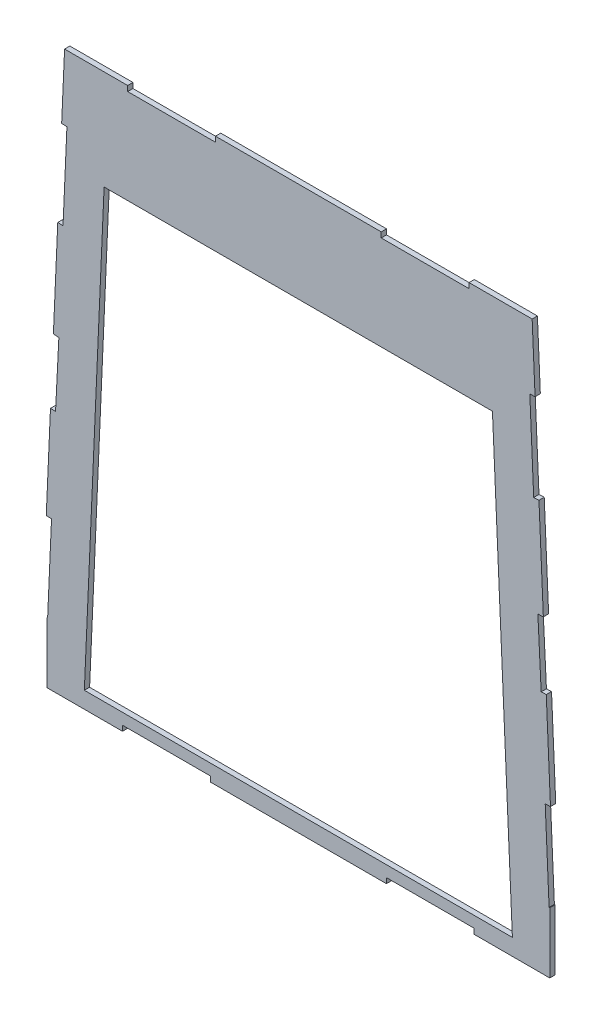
ISO-10303-21;
HEADER;
FILE_DESCRIPTION(('STEP AP214'),'2;1');
FILE_NAME('part.step','',(''),(''),'','','');
FILE_SCHEMA(('AUTOMOTIVE_DESIGN { 1 0 10303 214 1 1 1 1 }'));
ENDSEC;
DATA;
#1=APPLICATION_CONTEXT('core data for automotive mechanical design processes');
#2=APPLICATION_PROTOCOL_DEFINITION('international standard','automotive_design',2000,#1);
#3=PRODUCT_CONTEXT('',#1,'mechanical');
#4=PRODUCT('Part','Part','',(#3));
#5=PRODUCT_RELATED_PRODUCT_CATEGORY('part','',(#4));
#6=PRODUCT_DEFINITION_FORMATION('','',#4);
#7=PRODUCT_DEFINITION_CONTEXT('part definition',#1,'design');
#8=PRODUCT_DEFINITION('design','',#6,#7);
#9=PRODUCT_DEFINITION_SHAPE('','',#8);
#10=(LENGTH_UNIT() NAMED_UNIT(*) SI_UNIT(.MILLI.,.METRE.));
#11=(NAMED_UNIT(*) PLANE_ANGLE_UNIT() SI_UNIT($,.RADIAN.));
#12=(NAMED_UNIT(*) SI_UNIT($,.STERADIAN.) SOLID_ANGLE_UNIT());
#13=UNCERTAINTY_MEASURE_WITH_UNIT(LENGTH_MEASURE(1.E-05),#10,'distance_accuracy_value','');
#14=(GEOMETRIC_REPRESENTATION_CONTEXT(3) GLOBAL_UNCERTAINTY_ASSIGNED_CONTEXT((#13)) GLOBAL_UNIT_ASSIGNED_CONTEXT((#10,
#11,#12)) REPRESENTATION_CONTEXT('',''));
#15=CARTESIAN_POINT('',(0.,0.,0.));
#16=DIRECTION('',(0.,0.,1.));
#17=DIRECTION('',(1.,0.,0.));
#18=AXIS2_PLACEMENT_3D('',#15,#16,#17);
#19=CARTESIAN_POINT('',(0.,0.,1.524));
#20=DIRECTION('',(0.,0.,-1.));
#21=DIRECTION('',(-1.,0.,0.));
#22=AXIS2_PLACEMENT_3D('',#19,#20,#21);
#23=PLANE('',#22);
#24=DIRECTION('',(1.,0.,0.));
#25=VECTOR('',#24,1.);
#26=CARTESIAN_POINT('',(77.169791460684,-58.0793149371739,1.524));
#27=LINE('',#26,#25);
#28=CARTESIAN_POINT('',(53.2037808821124,-58.0793149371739,1.524));
#29=VERTEX_POINT('',#28);
#30=CARTESIAN_POINT('',(75.0599894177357,-58.0793149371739,1.524));
#31=VERTEX_POINT('',#30);
#32=EDGE_CURVE('E353',#29,#31,#27,.T.);
#33=ORIENTED_EDGE('',*,*,#32,.T.);
#34=DIRECTION('',(0.,-1.,0.));
#35=VECTOR('',#34,1.);
#36=CARTESIAN_POINT('',(75.0599894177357,-40.4826563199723,1.524));
#37=LINE('',#36,#35);
#38=CARTESIAN_POINT('',(75.0599894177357,-40.4826563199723,1.524));
#39=VERTEX_POINT('',#38);
#40=EDGE_CURVE('E340',#39,#31,#37,.T.);
#41=ORIENTED_EDGE('',*,*,#40,.F.);
#42=DIRECTION('',(-0.999018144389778,-0.0443029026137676,0.));
#43=VECTOR('',#42,1.);
#44=CARTESIAN_POINT('',(76.3868328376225,-40.4238155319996,1.524));
#45=LINE('',#44,#43);
#46=CARTESIAN_POINT('',(74.8643291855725,-40.4913331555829,1.524));
#47=VERTEX_POINT('',#46);
#48=EDGE_CURVE('E350',#39,#47,#45,.T.);
#49=ORIENTED_EDGE('',*,*,#48,.T.);
#50=DIRECTION('',(-0.0443029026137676,0.999018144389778,0.));
#51=VECTOR('',#50,1.);
#52=CARTESIAN_POINT('',(74.8643291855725,-40.4913331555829,1.524));
#53=LINE('',#52,#51);
#54=CARTESIAN_POINT('',(73.7390354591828,-15.1162722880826,1.524));
#55=VERTEX_POINT('',#54);
#56=EDGE_CURVE('E359',#47,#55,#53,.T.);
#57=ORIENTED_EDGE('',*,*,#56,.T.);
#58=DIRECTION('',(0.999018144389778,0.0443029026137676,0.));
#59=VECTOR('',#58,1.);
#60=CARTESIAN_POINT('',(75.2615391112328,-15.0487546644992,1.524));
#61=LINE('',#60,#59);
#62=CARTESIAN_POINT('',(75.2615391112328,-15.0487546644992,1.524));
#63=VERTEX_POINT('',#62);
#64=EDGE_CURVE('E361',#55,#63,#61,.T.);
#65=ORIENTED_EDGE('',*,*,#64,.T.);
#66=DIRECTION('',(-0.0443029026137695,0.999018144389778,0.));
#67=VECTOR('',#66,1.);
#68=CARTESIAN_POINT('',(74.0432795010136,12.4226610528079,1.524));
#69=LINE('',#68,#67);
#70=CARTESIAN_POINT('',(74.0432795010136,12.4226610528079,1.524));
#71=VERTEX_POINT('',#70);
#72=EDGE_CURVE('E368',#63,#71,#69,.T.);
#73=ORIENTED_EDGE('',*,*,#72,.T.);
#74=DIRECTION('',(-0.999079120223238,-0.0429058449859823,0.));
#75=VECTOR('',#74,1.);
#76=CARTESIAN_POINT('',(72.571557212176,12.3594573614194,1.524));
#77=LINE('',#76,#75);
#78=CARTESIAN_POINT('',(72.571557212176,12.3594573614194,1.524));
#79=VERTEX_POINT('',#78);
#80=EDGE_CURVE('E370',#71,#79,#77,.T.);
#81=ORIENTED_EDGE('',*,*,#80,.T.);
#82=DIRECTION('',(-0.0500547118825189,0.998746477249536,0.));
#83=VECTOR('',#82,1.);
#84=CARTESIAN_POINT('',(71.6180573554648,31.3847316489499,1.524));
#85=LINE('',#84,#83);
#86=CARTESIAN_POINT('',(71.6180573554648,31.3847316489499,1.524));
#87=VERTEX_POINT('',#86);
#88=EDGE_CURVE('E461',#79,#87,#85,.T.);
#89=ORIENTED_EDGE('',*,*,#88,.T.);
#90=DIRECTION('',(0.999044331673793,0.0437083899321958,0.));
#91=VECTOR('',#90,1.);
#92=CARTESIAN_POINT('',(73.1993111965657,31.4539118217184,1.524));
#93=LINE('',#92,#91);
#94=CARTESIAN_POINT('',(73.1993111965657,31.4539118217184,1.524));
#95=VERTEX_POINT('',#94);
#96=EDGE_CURVE('E580',#87,#95,#93,.T.);
#97=ORIENTED_EDGE('',*,*,#96,.T.);
#98=DIRECTION('',(-0.0443029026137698,0.999018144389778,0.));
#99=VECTOR('',#98,1.);
#100=CARTESIAN_POINT('',(71.931737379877,60.0373491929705,1.524));
#101=LINE('',#100,#99);
#102=CARTESIAN_POINT('',(71.931737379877,60.0373491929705,1.524));
#103=VERTEX_POINT('',#102);
#104=EDGE_CURVE('E605',#95,#103,#101,.T.);
#105=ORIENTED_EDGE('',*,*,#104,.T.);
#106=DIRECTION('',(-0.999018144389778,-0.0443029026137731,0.));
#107=VECTOR('',#106,1.);
#108=CARTESIAN_POINT('',(71.931737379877,60.0373491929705,1.524));
#109=LINE('',#108,#107);
#110=CARTESIAN_POINT('',(70.4092337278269,59.9698315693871,1.524));
#111=VERTEX_POINT('',#110);
#112=EDGE_CURVE('E602',#103,#111,#109,.T.);
#113=ORIENTED_EDGE('',*,*,#112,.T.);
#114=DIRECTION('',(-0.0443029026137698,0.999018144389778,0.));
#115=VECTOR('',#114,1.);
#116=CARTESIAN_POINT('',(70.4092337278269,59.9698315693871,1.524));
#117=LINE('',#116,#115);
#118=CARTESIAN_POINT('',(69.2839400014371,85.3448924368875,1.524));
#119=VERTEX_POINT('',#118);
#120=EDGE_CURVE('E604',#111,#119,#117,.T.);
#121=ORIENTED_EDGE('',*,*,#120,.T.);
#122=DIRECTION('',(0.999018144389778,0.0443029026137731,0.));
#123=VECTOR('',#122,1.);
#124=CARTESIAN_POINT('',(70.8064436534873,85.4124100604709,1.524));
#125=LINE('',#124,#123);
#126=CARTESIAN_POINT('',(70.8064436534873,85.4124100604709,1.524));
#127=VERTEX_POINT('',#126);
#128=EDGE_CURVE('E607',#119,#127,#125,.T.);
#129=ORIENTED_EDGE('',*,*,#128,.T.);
#130=DIRECTION('',(-0.04430290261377,0.999018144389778,0.));
#131=VECTOR('',#130,1.);
#132=CARTESIAN_POINT('',(69.9616178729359,104.462996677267,1.524));
#133=LINE('',#132,#131);
#134=CARTESIAN_POINT('',(69.9616178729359,104.462996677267,1.524));
#135=VERTEX_POINT('',#134);
#136=EDGE_CURVE('E613',#127,#135,#133,.T.);
#137=ORIENTED_EDGE('',*,*,#136,.T.);
#138=DIRECTION('',(-1.,0.,0.));
#139=VECTOR('',#138,1.);
#140=CARTESIAN_POINT('',(69.9616178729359,104.462996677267,1.524));
#141=LINE('',#140,#139);
#142=CARTESIAN_POINT('',(51.7101807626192,104.462996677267,1.524));
#143=VERTEX_POINT('',#142);
#144=EDGE_CURVE('E615',#135,#143,#141,.T.);
#145=ORIENTED_EDGE('',*,*,#144,.T.);
#146=DIRECTION('',(0.,-1.,0.));
#147=VECTOR('',#146,1.);
#148=CARTESIAN_POINT('',(51.7101807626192,104.462996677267,1.524));
#149=LINE('',#148,#147);
#150=CARTESIAN_POINT('',(51.7101807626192,102.938996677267,1.524));
#151=VERTEX_POINT('',#150);
#152=EDGE_CURVE('E617',#143,#151,#149,.T.);
#153=ORIENTED_EDGE('',*,*,#152,.T.);
#154=DIRECTION('',(-1.,0.,0.));
#155=VECTOR('',#154,1.);
#156=CARTESIAN_POINT('',(26.3101807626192,102.938996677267,1.524));
#157=LINE('',#156,#155);
#158=CARTESIAN_POINT('',(26.3101807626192,102.938996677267,1.524));
#159=VERTEX_POINT('',#158);
#160=EDGE_CURVE('E619',#151,#159,#157,.T.);
#161=ORIENTED_EDGE('',*,*,#160,.T.);
#162=DIRECTION('',(0.,1.,0.));
#163=VECTOR('',#162,1.);
#164=CARTESIAN_POINT('',(26.3101807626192,104.462996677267,1.524));
#165=LINE('',#164,#163);
#166=CARTESIAN_POINT('',(26.3101807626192,104.462996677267,1.524));
#167=VERTEX_POINT('',#166);
#168=EDGE_CURVE('E621',#159,#167,#165,.T.);
#169=ORIENTED_EDGE('',*,*,#168,.T.);
#170=DIRECTION('',(-1.,0.,0.));
#171=VECTOR('',#170,1.);
#172=CARTESIAN_POINT('',(26.3101807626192,104.462996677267,1.524));
#173=LINE('',#172,#171);
#174=CARTESIAN_POINT('',(-21.6409308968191,104.462996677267,1.524));
#175=VERTEX_POINT('',#174);
#176=EDGE_CURVE('E623',#167,#175,#173,.T.);
#177=ORIENTED_EDGE('',*,*,#176,.T.);
#178=DIRECTION('',(0.,-1.,0.));
#179=VECTOR('',#178,1.);
#180=CARTESIAN_POINT('',(-21.6409308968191,104.462996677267,1.524));
#181=LINE('',#180,#179);
#182=CARTESIAN_POINT('',(-21.6409308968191,102.938996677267,1.524));
#183=VERTEX_POINT('',#182);
#184=EDGE_CURVE('E625',#175,#183,#181,.T.);
#185=ORIENTED_EDGE('',*,*,#184,.T.);
#186=DIRECTION('',(-1.,0.,0.));
#187=VECTOR('',#186,1.);
#188=CARTESIAN_POINT('',(-21.6409308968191,102.938996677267,1.524));
#189=LINE('',#188,#187);
#190=CARTESIAN_POINT('',(-47.0409308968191,102.938996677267,1.524));
#191=VERTEX_POINT('',#190);
#192=EDGE_CURVE('E627',#183,#191,#189,.T.);
#193=ORIENTED_EDGE('',*,*,#192,.T.);
#194=DIRECTION('',(0.,1.,0.));
#195=VECTOR('',#194,1.);
#196=CARTESIAN_POINT('',(-47.0409308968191,104.462996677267,1.524));
#197=LINE('',#196,#195);
#198=CARTESIAN_POINT('',(-47.0409308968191,104.462996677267,1.524));
#199=VERTEX_POINT('',#198);
#200=EDGE_CURVE('E629',#191,#199,#197,.T.);
#201=ORIENTED_EDGE('',*,*,#200,.T.);
#202=DIRECTION('',(-1.,0.,0.));
#203=VECTOR('',#202,1.);
#204=CARTESIAN_POINT('',(-47.0409308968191,104.462996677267,1.524));
#205=LINE('',#204,#203);
#206=CARTESIAN_POINT('',(-65.2923680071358,104.462996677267,1.524));
#207=VERTEX_POINT('',#206);
#208=EDGE_CURVE('E631',#199,#207,#205,.T.);
#209=ORIENTED_EDGE('',*,*,#208,.T.);
#210=DIRECTION('',(-0.04430290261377,-0.999018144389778,0.));
#211=VECTOR('',#210,1.);
#212=CARTESIAN_POINT('',(-65.2923680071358,104.462996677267,1.524));
#213=LINE('',#212,#211);
#214=CARTESIAN_POINT('',(-66.1371937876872,85.4124100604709,1.524));
#215=VERTEX_POINT('',#214);
#216=EDGE_CURVE('E633',#207,#215,#213,.T.);
#217=ORIENTED_EDGE('',*,*,#216,.T.);
#218=DIRECTION('',(0.999018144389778,-0.0443029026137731,0.));
#219=VECTOR('',#218,1.);
#220=CARTESIAN_POINT('',(-66.1371937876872,85.4124100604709,1.524));
#221=LINE('',#220,#219);
#222=CARTESIAN_POINT('',(-64.6146901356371,85.3448924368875,1.524));
#223=VERTEX_POINT('',#222);
#224=EDGE_CURVE('E635',#215,#223,#221,.T.);
#225=ORIENTED_EDGE('',*,*,#224,.T.);
#226=DIRECTION('',(-0.0443029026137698,-0.999018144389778,0.));
#227=VECTOR('',#226,1.);
#228=CARTESIAN_POINT('',(-65.7399838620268,59.9698315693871,1.524));
#229=LINE('',#228,#227);
#230=CARTESIAN_POINT('',(-65.7399838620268,59.9698315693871,1.524));
#231=VERTEX_POINT('',#230);
#232=EDGE_CURVE('E637',#223,#231,#229,.T.);
#233=ORIENTED_EDGE('',*,*,#232,.T.);
#234=DIRECTION('',(-0.999018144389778,0.0443029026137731,0.));
#235=VECTOR('',#234,1.);
#236=CARTESIAN_POINT('',(-67.262487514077,60.0373491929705,1.524));
#237=LINE('',#236,#235);
#238=CARTESIAN_POINT('',(-67.262487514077,60.0373491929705,1.524));
#239=VERTEX_POINT('',#238);
#240=EDGE_CURVE('E639',#231,#239,#237,.T.);
#241=ORIENTED_EDGE('',*,*,#240,.T.);
#242=DIRECTION('',(-0.0443029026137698,-0.999018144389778,0.));
#243=VECTOR('',#242,1.);
#244=CARTESIAN_POINT('',(-67.262487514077,60.0373491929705,1.524));
#245=LINE('',#244,#243);
#246=CARTESIAN_POINT('',(-68.5300613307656,31.4539118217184,1.524));
#247=VERTEX_POINT('',#246);
#248=EDGE_CURVE('E641',#239,#247,#245,.T.);
#249=ORIENTED_EDGE('',*,*,#248,.T.);
#250=DIRECTION('',(0.999044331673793,-0.0437083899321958,0.));
#251=VECTOR('',#250,1.);
#252=CARTESIAN_POINT('',(-68.5300613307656,31.4539118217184,1.524));
#253=LINE('',#252,#251);
#254=CARTESIAN_POINT('',(-66.9488074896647,31.3847316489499,1.524));
#255=VERTEX_POINT('',#254);
#256=EDGE_CURVE('E643',#247,#255,#253,.T.);
#257=ORIENTED_EDGE('',*,*,#256,.T.);
#258=DIRECTION('',(-0.0500547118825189,-0.998746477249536,0.));
#259=VECTOR('',#258,1.);
#260=CARTESIAN_POINT('',(-66.9488074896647,31.3847316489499,1.524));
#261=LINE('',#260,#259);
#262=CARTESIAN_POINT('',(-67.9023073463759,12.3594573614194,1.524));
#263=VERTEX_POINT('',#262);
#264=EDGE_CURVE('E645',#255,#263,#261,.T.);
#265=ORIENTED_EDGE('',*,*,#264,.T.);
#266=DIRECTION('',(-0.999079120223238,0.0429058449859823,0.));
#267=VECTOR('',#266,1.);
#268=CARTESIAN_POINT('',(-67.9023073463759,12.3594573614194,1.524));
#269=LINE('',#268,#267);
#270=CARTESIAN_POINT('',(-69.3740296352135,12.4226610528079,1.524));
#271=VERTEX_POINT('',#270);
#272=EDGE_CURVE('E647',#263,#271,#269,.T.);
#273=ORIENTED_EDGE('',*,*,#272,.T.);
#274=DIRECTION('',(-0.0443029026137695,-0.999018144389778,0.));
#275=VECTOR('',#274,1.);
#276=CARTESIAN_POINT('',(-69.3740296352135,12.4226610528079,1.524));
#277=LINE('',#276,#275);
#278=CARTESIAN_POINT('',(-70.5922892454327,-15.0487546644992,1.524));
#279=VERTEX_POINT('',#278);
#280=EDGE_CURVE('E649',#271,#279,#277,.T.);
#281=ORIENTED_EDGE('',*,*,#280,.T.);
#282=DIRECTION('',(0.999018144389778,-0.0443029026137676,0.));
#283=VECTOR('',#282,1.);
#284=CARTESIAN_POINT('',(-70.5922892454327,-15.0487546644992,1.524));
#285=LINE('',#284,#283);
#286=CARTESIAN_POINT('',(-69.0697855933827,-15.1162722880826,1.524));
#287=VERTEX_POINT('',#286);
#288=EDGE_CURVE('E651',#279,#287,#285,.T.);
#289=ORIENTED_EDGE('',*,*,#288,.T.);
#290=DIRECTION('',(-0.0443029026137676,-0.999018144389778,0.));
#291=VECTOR('',#290,1.);
#292=CARTESIAN_POINT('',(-70.1950793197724,-40.4913331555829,1.524));
#293=LINE('',#292,#291);
#294=CARTESIAN_POINT('',(-70.1950793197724,-40.4913331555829,1.524));
#295=VERTEX_POINT('',#294);
#296=EDGE_CURVE('E653',#287,#295,#293,.T.);
#297=ORIENTED_EDGE('',*,*,#296,.T.);
#298=DIRECTION('',(-0.999018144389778,0.0443029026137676,0.));
#299=VECTOR('',#298,1.);
#300=CARTESIAN_POINT('',(-71.7175829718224,-40.4238155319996,1.524));
#301=LINE('',#300,#299);
#302=CARTESIAN_POINT('',(-70.3907395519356,-40.4826563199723,1.524));
#303=VERTEX_POINT('',#302);
#304=EDGE_CURVE('E655',#295,#303,#301,.T.);
#305=ORIENTED_EDGE('',*,*,#304,.T.);
#306=DIRECTION('',(0.,1.,0.));
#307=VECTOR('',#306,1.);
#308=CARTESIAN_POINT('',(-70.3907395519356,-40.4826563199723,1.524));
#309=LINE('',#308,#307);
#310=CARTESIAN_POINT('',(-70.3907395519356,-58.0793149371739,1.524));
#311=VERTEX_POINT('',#310);
#312=EDGE_CURVE('E681',#311,#303,#309,.T.);
#313=ORIENTED_EDGE('',*,*,#312,.F.);
#314=DIRECTION('',(1.,0.,0.));
#315=VECTOR('',#314,1.);
#316=CARTESIAN_POINT('',(-48.5345310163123,-58.0793149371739,1.524));
#317=LINE('',#316,#315);
#318=CARTESIAN_POINT('',(-48.5345310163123,-58.0793149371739,1.524));
#319=VERTEX_POINT('',#318);
#320=EDGE_CURVE('E658',#311,#319,#317,.T.);
#321=ORIENTED_EDGE('',*,*,#320,.T.);
#322=DIRECTION('',(0.,1.,0.));
#323=VECTOR('',#322,1.);
#324=CARTESIAN_POINT('',(-48.5345310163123,-58.0793149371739,1.524));
#325=LINE('',#324,#323);
#326=CARTESIAN_POINT('',(-48.5345310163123,-56.555314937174,1.524));
#327=VERTEX_POINT('',#326);
#328=EDGE_CURVE('E660',#319,#327,#325,.T.);
#329=ORIENTED_EDGE('',*,*,#328,.T.);
#330=DIRECTION('',(1.,0.,0.));
#331=VECTOR('',#330,1.);
#332=CARTESIAN_POINT('',(-48.5345310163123,-56.555314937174,1.524));
#333=LINE('',#332,#331);
#334=CARTESIAN_POINT('',(-23.1345310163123,-56.555314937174,1.524));
#335=VERTEX_POINT('',#334);
#336=EDGE_CURVE('E662',#327,#335,#333,.T.);
#337=ORIENTED_EDGE('',*,*,#336,.T.);
#338=DIRECTION('',(0.,-1.,0.));
#339=VECTOR('',#338,1.);
#340=CARTESIAN_POINT('',(-23.1345310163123,-58.0793149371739,1.524));
#341=LINE('',#340,#339);
#342=CARTESIAN_POINT('',(-23.1345310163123,-58.0793149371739,1.524));
#343=VERTEX_POINT('',#342);
#344=EDGE_CURVE('E664',#335,#343,#341,.T.);
#345=ORIENTED_EDGE('',*,*,#344,.T.);
#346=DIRECTION('',(1.,0.,0.));
#347=VECTOR('',#346,1.);
#348=CARTESIAN_POINT('',(27.8037808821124,-58.0793149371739,1.524));
#349=LINE('',#348,#347);
#350=CARTESIAN_POINT('',(27.8037808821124,-58.0793149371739,1.524));
#351=VERTEX_POINT('',#350);
#352=EDGE_CURVE('E666',#343,#351,#349,.T.);
#353=ORIENTED_EDGE('',*,*,#352,.T.);
#354=DIRECTION('',(0.,1.,0.));
#355=VECTOR('',#354,1.);
#356=CARTESIAN_POINT('',(27.8037808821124,-58.0793149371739,1.524));
#357=LINE('',#356,#355);
#358=CARTESIAN_POINT('',(27.8037808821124,-56.555314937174,1.524));
#359=VERTEX_POINT('',#358);
#360=EDGE_CURVE('E668',#351,#359,#357,.T.);
#361=ORIENTED_EDGE('',*,*,#360,.T.);
#362=DIRECTION('',(1.,0.,0.));
#363=VECTOR('',#362,1.);
#364=CARTESIAN_POINT('',(53.2037808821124,-56.555314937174,1.524));
#365=LINE('',#364,#363);
#366=CARTESIAN_POINT('',(53.2037808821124,-56.555314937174,1.524));
#367=VERTEX_POINT('',#366);
#368=EDGE_CURVE('E670',#359,#367,#365,.T.);
#369=ORIENTED_EDGE('',*,*,#368,.T.);
#370=DIRECTION('',(0.,-1.,0.));
#371=VECTOR('',#370,1.);
#372=CARTESIAN_POINT('',(53.2037808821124,-58.0793149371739,1.524));
#373=LINE('',#372,#371);
#374=EDGE_CURVE('E363',#367,#29,#373,.T.);
#375=ORIENTED_EDGE('',*,*,#374,.T.);
#376=EDGE_LOOP('',(#33,#41,#49,#57,#65,#73,#81,#89,#97,#105,#113,#121,#129,#137,#145,#153,#161,
#169,#177,#185,#193,#201,#209,#217,#225,#233,#241,#249,#257,#265,#273,#281,#289,#297,#305,#313,
#321,#329,#337,#345,#353,#361,#369,#375));
#377=FACE_BOUND('',#376,.T.);
#378=DIRECTION('',(1.,0.,0.));
#379=VECTOR('',#378,1.);
#380=CARTESIAN_POINT('',(64.2461096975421,-53.3168149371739,1.524));
#381=LINE('',#380,#379);
#382=CARTESIAN_POINT('',(-59.576859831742,-53.316814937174,1.524));
#383=VERTEX_POINT('',#382);
#384=CARTESIAN_POINT('',(64.2461096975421,-53.3168149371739,1.524));
#385=VERTEX_POINT('',#384);
#386=EDGE_CURVE('E690',#383,#385,#381,.T.);
#387=ORIENTED_EDGE('',*,*,#386,.F.);
#388=DIRECTION('',(-0.0443029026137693,-0.999018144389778,0.));
#389=VECTOR('',#388,1.);
#390=CARTESIAN_POINT('',(-53.8589360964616,75.6207765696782,1.524));
#391=LINE('',#390,#389);
#392=CARTESIAN_POINT('',(-53.8589360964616,75.6207765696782,1.524));
#393=VERTEX_POINT('',#392);
#394=EDGE_CURVE('E698',#393,#383,#391,.T.);
#395=ORIENTED_EDGE('',*,*,#394,.F.);
#396=DIRECTION('',(-1.,0.,0.));
#397=VECTOR('',#396,1.);
#398=CARTESIAN_POINT('',(58.4748153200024,75.6207765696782,1.524));
#399=LINE('',#398,#397);
#400=CARTESIAN_POINT('',(58.4748153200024,75.6207765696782,1.524));
#401=VERTEX_POINT('',#400);
#402=EDGE_CURVE('E695',#401,#393,#399,.T.);
#403=ORIENTED_EDGE('',*,*,#402,.F.);
#404=DIRECTION('',(-0.0447155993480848,0.998999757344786,0.));
#405=VECTOR('',#404,1.);
#406=CARTESIAN_POINT('',(64.2461096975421,-53.3168149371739,1.524));
#407=LINE('',#406,#405);
#408=EDGE_CURVE('E692',#385,#401,#407,.T.);
#409=ORIENTED_EDGE('',*,*,#408,.F.);
#410=EDGE_LOOP('',(#387,#395,#403,#409));
#411=FACE_BOUND('',#410,.T.);
#412=ADVANCED_FACE('F36',(#377,#411),#23,.F.);
#413=CARTESIAN_POINT('',(0.,0.,0.));
#414=DIRECTION('',(0.,0.,-1.));
#415=DIRECTION('',(-1.,0.,0.));
#416=AXIS2_PLACEMENT_3D('',#413,#414,#415);
#417=PLANE('',#416);
#418=DIRECTION('',(0.,-1.,0.));
#419=VECTOR('',#418,1.);
#420=CARTESIAN_POINT('',(75.0599894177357,-40.4826563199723,0.));
#421=LINE('',#420,#419);
#422=CARTESIAN_POINT('',(75.0599894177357,-40.4826563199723,0.));
#423=VERTEX_POINT('',#422);
#424=CARTESIAN_POINT('',(75.0599894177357,-58.0793149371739,0.));
#425=VERTEX_POINT('',#424);
#426=EDGE_CURVE('E51',#423,#425,#421,.T.);
#427=ORIENTED_EDGE('',*,*,#426,.T.);
#428=DIRECTION('',(1.,0.,0.));
#429=VECTOR('',#428,1.);
#430=CARTESIAN_POINT('',(77.169791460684,-58.0793149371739,0.));
#431=LINE('',#430,#429);
#432=CARTESIAN_POINT('',(53.2037808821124,-58.0793149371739,0.));
#433=VERTEX_POINT('',#432);
#434=EDGE_CURVE('E448',#433,#425,#431,.T.);
#435=ORIENTED_EDGE('',*,*,#434,.F.);
#436=DIRECTION('',(0.,-1.,0.));
#437=VECTOR('',#436,1.);
#438=CARTESIAN_POINT('',(53.2037808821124,-58.0793149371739,0.));
#439=LINE('',#438,#437);
#440=CARTESIAN_POINT('',(53.2037808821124,-56.555314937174,0.));
#441=VERTEX_POINT('',#440);
#442=EDGE_CURVE('E446',#441,#433,#439,.T.);
#443=ORIENTED_EDGE('',*,*,#442,.F.);
#444=DIRECTION('',(1.,0.,0.));
#445=VECTOR('',#444,1.);
#446=CARTESIAN_POINT('',(53.2037808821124,-56.555314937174,0.));
#447=LINE('',#446,#445);
#448=CARTESIAN_POINT('',(27.8037808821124,-56.555314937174,0.));
#449=VERTEX_POINT('',#448);
#450=EDGE_CURVE('E444',#449,#441,#447,.T.);
#451=ORIENTED_EDGE('',*,*,#450,.F.);
#452=DIRECTION('',(0.,1.,0.));
#453=VECTOR('',#452,1.);
#454=CARTESIAN_POINT('',(27.8037808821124,-58.0793149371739,0.));
#455=LINE('',#454,#453);
#456=CARTESIAN_POINT('',(27.8037808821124,-58.0793149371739,0.));
#457=VERTEX_POINT('',#456);
#458=EDGE_CURVE('E442',#457,#449,#455,.T.);
#459=ORIENTED_EDGE('',*,*,#458,.F.);
#460=DIRECTION('',(1.,0.,0.));
#461=VECTOR('',#460,1.);
#462=CARTESIAN_POINT('',(27.8037808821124,-58.0793149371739,0.));
#463=LINE('',#462,#461);
#464=CARTESIAN_POINT('',(-23.1345310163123,-58.0793149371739,0.));
#465=VERTEX_POINT('',#464);
#466=EDGE_CURVE('E440',#465,#457,#463,.T.);
#467=ORIENTED_EDGE('',*,*,#466,.F.);
#468=DIRECTION('',(0.,-1.,0.));
#469=VECTOR('',#468,1.);
#470=CARTESIAN_POINT('',(-23.1345310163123,-58.0793149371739,0.));
#471=LINE('',#470,#469);
#472=CARTESIAN_POINT('',(-23.1345310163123,-56.555314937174,0.));
#473=VERTEX_POINT('',#472);
#474=EDGE_CURVE('E438',#473,#465,#471,.T.);
#475=ORIENTED_EDGE('',*,*,#474,.F.);
#476=DIRECTION('',(1.,0.,0.));
#477=VECTOR('',#476,1.);
#478=CARTESIAN_POINT('',(-48.5345310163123,-56.555314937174,0.));
#479=LINE('',#478,#477);
#480=CARTESIAN_POINT('',(-48.5345310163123,-56.555314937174,0.));
#481=VERTEX_POINT('',#480);
#482=EDGE_CURVE('E436',#481,#473,#479,.T.);
#483=ORIENTED_EDGE('',*,*,#482,.F.);
#484=DIRECTION('',(0.,1.,0.));
#485=VECTOR('',#484,1.);
#486=CARTESIAN_POINT('',(-48.5345310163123,-58.0793149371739,0.));
#487=LINE('',#486,#485);
#488=CARTESIAN_POINT('',(-48.5345310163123,-58.0793149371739,0.));
#489=VERTEX_POINT('',#488);
#490=EDGE_CURVE('E434',#489,#481,#487,.T.);
#491=ORIENTED_EDGE('',*,*,#490,.F.);
#492=DIRECTION('',(1.,0.,0.));
#493=VECTOR('',#492,1.);
#494=CARTESIAN_POINT('',(-48.5345310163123,-58.0793149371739,0.));
#495=LINE('',#494,#493);
#496=CARTESIAN_POINT('',(-70.3907395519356,-58.0793149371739,0.));
#497=VERTEX_POINT('',#496);
#498=EDGE_CURVE('E432',#497,#489,#495,.T.);
#499=ORIENTED_EDGE('',*,*,#498,.F.);
#500=DIRECTION('',(0.,1.,0.));
#501=VECTOR('',#500,1.);
#502=CARTESIAN_POINT('',(-70.3907395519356,-40.4826563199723,0.));
#503=LINE('',#502,#501);
#504=CARTESIAN_POINT('',(-70.3907395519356,-40.4826563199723,0.));
#505=VERTEX_POINT('',#504);
#506=EDGE_CURVE('E59',#497,#505,#503,.T.);
#507=ORIENTED_EDGE('',*,*,#506,.T.);
#508=DIRECTION('',(-0.999018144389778,0.0443029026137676,0.));
#509=VECTOR('',#508,1.);
#510=CARTESIAN_POINT('',(-71.7175829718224,-40.4238155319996,0.));
#511=LINE('',#510,#509);
#512=CARTESIAN_POINT('',(-70.1950793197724,-40.4913331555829,0.));
#513=VERTEX_POINT('',#512);
#514=EDGE_CURVE('E429',#513,#505,#511,.T.);
#515=ORIENTED_EDGE('',*,*,#514,.F.);
#516=DIRECTION('',(-0.0443029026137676,-0.999018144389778,0.));
#517=VECTOR('',#516,1.);
#518=CARTESIAN_POINT('',(-70.1950793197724,-40.4913331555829,0.));
#519=LINE('',#518,#517);
#520=CARTESIAN_POINT('',(-69.0697855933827,-15.1162722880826,0.));
#521=VERTEX_POINT('',#520);
#522=EDGE_CURVE('E427',#521,#513,#519,.T.);
#523=ORIENTED_EDGE('',*,*,#522,.F.);
#524=DIRECTION('',(0.999018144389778,-0.0443029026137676,0.));
#525=VECTOR('',#524,1.);
#526=CARTESIAN_POINT('',(-70.5922892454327,-15.0487546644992,0.));
#527=LINE('',#526,#525);
#528=CARTESIAN_POINT('',(-70.5922892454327,-15.0487546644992,0.));
#529=VERTEX_POINT('',#528);
#530=EDGE_CURVE('E425',#529,#521,#527,.T.);
#531=ORIENTED_EDGE('',*,*,#530,.F.);
#532=DIRECTION('',(-0.0443029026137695,-0.999018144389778,0.));
#533=VECTOR('',#532,1.);
#534=CARTESIAN_POINT('',(-69.3740296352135,12.4226610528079,0.));
#535=LINE('',#534,#533);
#536=CARTESIAN_POINT('',(-69.3740296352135,12.4226610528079,0.));
#537=VERTEX_POINT('',#536);
#538=EDGE_CURVE('E423',#537,#529,#535,.T.);
#539=ORIENTED_EDGE('',*,*,#538,.F.);
#540=DIRECTION('',(-0.999079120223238,0.0429058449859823,0.));
#541=VECTOR('',#540,1.);
#542=CARTESIAN_POINT('',(-67.9023073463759,12.3594573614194,0.));
#543=LINE('',#542,#541);
#544=CARTESIAN_POINT('',(-67.9023073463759,12.3594573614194,0.));
#545=VERTEX_POINT('',#544);
#546=EDGE_CURVE('E421',#545,#537,#543,.T.);
#547=ORIENTED_EDGE('',*,*,#546,.F.);
#548=DIRECTION('',(-0.0500547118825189,-0.998746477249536,0.));
#549=VECTOR('',#548,1.);
#550=CARTESIAN_POINT('',(-66.9488074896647,31.3847316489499,0.));
#551=LINE('',#550,#549);
#552=CARTESIAN_POINT('',(-66.9488074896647,31.3847316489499,0.));
#553=VERTEX_POINT('',#552);
#554=EDGE_CURVE('E419',#553,#545,#551,.T.);
#555=ORIENTED_EDGE('',*,*,#554,.F.);
#556=DIRECTION('',(0.999044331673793,-0.0437083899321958,0.));
#557=VECTOR('',#556,1.);
#558=CARTESIAN_POINT('',(-68.5300613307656,31.4539118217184,0.));
#559=LINE('',#558,#557);
#560=CARTESIAN_POINT('',(-68.5300613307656,31.4539118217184,0.));
#561=VERTEX_POINT('',#560);
#562=EDGE_CURVE('E417',#561,#553,#559,.T.);
#563=ORIENTED_EDGE('',*,*,#562,.F.);
#564=DIRECTION('',(-0.0443029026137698,-0.999018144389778,0.));
#565=VECTOR('',#564,1.);
#566=CARTESIAN_POINT('',(-67.262487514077,60.0373491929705,0.));
#567=LINE('',#566,#565);
#568=CARTESIAN_POINT('',(-67.262487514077,60.0373491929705,0.));
#569=VERTEX_POINT('',#568);
#570=EDGE_CURVE('E415',#569,#561,#567,.T.);
#571=ORIENTED_EDGE('',*,*,#570,.F.);
#572=DIRECTION('',(-0.999018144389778,0.0443029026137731,0.));
#573=VECTOR('',#572,1.);
#574=CARTESIAN_POINT('',(-67.262487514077,60.0373491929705,0.));
#575=LINE('',#574,#573);
#576=CARTESIAN_POINT('',(-65.7399838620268,59.9698315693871,0.));
#577=VERTEX_POINT('',#576);
#578=EDGE_CURVE('E413',#577,#569,#575,.T.);
#579=ORIENTED_EDGE('',*,*,#578,.F.);
#580=DIRECTION('',(-0.0443029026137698,-0.999018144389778,0.));
#581=VECTOR('',#580,1.);
#582=CARTESIAN_POINT('',(-65.7399838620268,59.9698315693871,0.));
#583=LINE('',#582,#581);
#584=CARTESIAN_POINT('',(-64.6146901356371,85.3448924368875,0.));
#585=VERTEX_POINT('',#584);
#586=EDGE_CURVE('E411',#585,#577,#583,.T.);
#587=ORIENTED_EDGE('',*,*,#586,.F.);
#588=DIRECTION('',(0.999018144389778,-0.0443029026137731,0.));
#589=VECTOR('',#588,1.);
#590=CARTESIAN_POINT('',(-66.1371937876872,85.4124100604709,0.));
#591=LINE('',#590,#589);
#592=CARTESIAN_POINT('',(-66.1371937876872,85.4124100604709,0.));
#593=VERTEX_POINT('',#592);
#594=EDGE_CURVE('E409',#593,#585,#591,.T.);
#595=ORIENTED_EDGE('',*,*,#594,.F.);
#596=DIRECTION('',(-0.04430290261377,-0.999018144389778,0.));
#597=VECTOR('',#596,1.);
#598=CARTESIAN_POINT('',(-65.2923680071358,104.462996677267,0.));
#599=LINE('',#598,#597);
#600=CARTESIAN_POINT('',(-65.2923680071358,104.462996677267,0.));
#601=VERTEX_POINT('',#600);
#602=EDGE_CURVE('E407',#601,#593,#599,.T.);
#603=ORIENTED_EDGE('',*,*,#602,.F.);
#604=DIRECTION('',(-1.,0.,0.));
#605=VECTOR('',#604,1.);
#606=CARTESIAN_POINT('',(-47.0409308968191,104.462996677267,0.));
#607=LINE('',#606,#605);
#608=CARTESIAN_POINT('',(-47.0409308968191,104.462996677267,0.));
#609=VERTEX_POINT('',#608);
#610=EDGE_CURVE('E405',#609,#601,#607,.T.);
#611=ORIENTED_EDGE('',*,*,#610,.F.);
#612=DIRECTION('',(0.,1.,0.));
#613=VECTOR('',#612,1.);
#614=CARTESIAN_POINT('',(-47.0409308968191,104.462996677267,0.));
#615=LINE('',#614,#613);
#616=CARTESIAN_POINT('',(-47.0409308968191,102.938996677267,0.));
#617=VERTEX_POINT('',#616);
#618=EDGE_CURVE('E403',#617,#609,#615,.T.);
#619=ORIENTED_EDGE('',*,*,#618,.F.);
#620=DIRECTION('',(-1.,0.,0.));
#621=VECTOR('',#620,1.);
#622=CARTESIAN_POINT('',(-21.6409308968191,102.938996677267,0.));
#623=LINE('',#622,#621);
#624=CARTESIAN_POINT('',(-21.6409308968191,102.938996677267,0.));
#625=VERTEX_POINT('',#624);
#626=EDGE_CURVE('E401',#625,#617,#623,.T.);
#627=ORIENTED_EDGE('',*,*,#626,.F.);
#628=DIRECTION('',(0.,-1.,0.));
#629=VECTOR('',#628,1.);
#630=CARTESIAN_POINT('',(-21.6409308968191,104.462996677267,0.));
#631=LINE('',#630,#629);
#632=CARTESIAN_POINT('',(-21.6409308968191,104.462996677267,0.));
#633=VERTEX_POINT('',#632);
#634=EDGE_CURVE('E399',#633,#625,#631,.T.);
#635=ORIENTED_EDGE('',*,*,#634,.F.);
#636=DIRECTION('',(-1.,0.,0.));
#637=VECTOR('',#636,1.);
#638=CARTESIAN_POINT('',(26.3101807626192,104.462996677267,0.));
#639=LINE('',#638,#637);
#640=CARTESIAN_POINT('',(26.3101807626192,104.462996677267,0.));
#641=VERTEX_POINT('',#640);
#642=EDGE_CURVE('E397',#641,#633,#639,.T.);
#643=ORIENTED_EDGE('',*,*,#642,.F.);
#644=DIRECTION('',(0.,1.,0.));
#645=VECTOR('',#644,1.);
#646=CARTESIAN_POINT('',(26.3101807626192,104.462996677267,0.));
#647=LINE('',#646,#645);
#648=CARTESIAN_POINT('',(26.3101807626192,102.938996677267,0.));
#649=VERTEX_POINT('',#648);
#650=EDGE_CURVE('E395',#649,#641,#647,.T.);
#651=ORIENTED_EDGE('',*,*,#650,.F.);
#652=DIRECTION('',(-1.,0.,0.));
#653=VECTOR('',#652,1.);
#654=CARTESIAN_POINT('',(26.3101807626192,102.938996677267,0.));
#655=LINE('',#654,#653);
#656=CARTESIAN_POINT('',(51.7101807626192,102.938996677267,0.));
#657=VERTEX_POINT('',#656);
#658=EDGE_CURVE('E393',#657,#649,#655,.T.);
#659=ORIENTED_EDGE('',*,*,#658,.F.);
#660=DIRECTION('',(0.,-1.,0.));
#661=VECTOR('',#660,1.);
#662=CARTESIAN_POINT('',(51.7101807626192,104.462996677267,0.));
#663=LINE('',#662,#661);
#664=CARTESIAN_POINT('',(51.7101807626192,104.462996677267,0.));
#665=VERTEX_POINT('',#664);
#666=EDGE_CURVE('E391',#665,#657,#663,.T.);
#667=ORIENTED_EDGE('',*,*,#666,.F.);
#668=DIRECTION('',(-1.,0.,0.));
#669=VECTOR('',#668,1.);
#670=CARTESIAN_POINT('',(69.9616178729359,104.462996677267,0.));
#671=LINE('',#670,#669);
#672=CARTESIAN_POINT('',(69.9616178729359,104.462996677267,0.));
#673=VERTEX_POINT('',#672);
#674=EDGE_CURVE('E389',#673,#665,#671,.T.);
#675=ORIENTED_EDGE('',*,*,#674,.F.);
#676=DIRECTION('',(-0.04430290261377,0.999018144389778,0.));
#677=VECTOR('',#676,1.);
#678=CARTESIAN_POINT('',(69.9616178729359,104.462996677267,0.));
#679=LINE('',#678,#677);
#680=CARTESIAN_POINT('',(70.8064436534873,85.4124100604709,0.));
#681=VERTEX_POINT('',#680);
#682=EDGE_CURVE('E387',#681,#673,#679,.T.);
#683=ORIENTED_EDGE('',*,*,#682,.F.);
#684=DIRECTION('',(0.999018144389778,0.0443029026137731,0.));
#685=VECTOR('',#684,1.);
#686=CARTESIAN_POINT('',(70.8064436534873,85.4124100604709,0.));
#687=LINE('',#686,#685);
#688=CARTESIAN_POINT('',(69.2839400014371,85.3448924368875,0.));
#689=VERTEX_POINT('',#688);
#690=EDGE_CURVE('E385',#689,#681,#687,.T.);
#691=ORIENTED_EDGE('',*,*,#690,.F.);
#692=DIRECTION('',(-0.0443029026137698,0.999018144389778,0.));
#693=VECTOR('',#692,1.);
#694=CARTESIAN_POINT('',(70.4092337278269,59.9698315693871,0.));
#695=LINE('',#694,#693);
#696=CARTESIAN_POINT('',(70.4092337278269,59.9698315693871,0.));
#697=VERTEX_POINT('',#696);
#698=EDGE_CURVE('E383',#697,#689,#695,.T.);
#699=ORIENTED_EDGE('',*,*,#698,.F.);
#700=DIRECTION('',(-0.999018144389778,-0.0443029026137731,0.));
#701=VECTOR('',#700,1.);
#702=CARTESIAN_POINT('',(71.931737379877,60.0373491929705,0.));
#703=LINE('',#702,#701);
#704=CARTESIAN_POINT('',(71.931737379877,60.0373491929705,0.));
#705=VERTEX_POINT('',#704);
#706=EDGE_CURVE('E381',#705,#697,#703,.T.);
#707=ORIENTED_EDGE('',*,*,#706,.F.);
#708=DIRECTION('',(-0.0443029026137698,0.999018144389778,0.));
#709=VECTOR('',#708,1.);
#710=CARTESIAN_POINT('',(71.931737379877,60.0373491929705,0.));
#711=LINE('',#710,#709);
#712=CARTESIAN_POINT('',(73.1993111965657,31.4539118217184,0.));
#713=VERTEX_POINT('',#712);
#714=EDGE_CURVE('E379',#713,#705,#711,.T.);
#715=ORIENTED_EDGE('',*,*,#714,.F.);
#716=DIRECTION('',(0.999044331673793,0.0437083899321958,0.));
#717=VECTOR('',#716,1.);
#718=CARTESIAN_POINT('',(73.1993111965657,31.4539118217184,0.));
#719=LINE('',#718,#717);
#720=CARTESIAN_POINT('',(71.6180573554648,31.3847316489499,0.));
#721=VERTEX_POINT('',#720);
#722=EDGE_CURVE('E376',#721,#713,#719,.T.);
#723=ORIENTED_EDGE('',*,*,#722,.F.);
#724=DIRECTION('',(-0.0500547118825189,0.998746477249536,0.));
#725=VECTOR('',#724,1.);
#726=CARTESIAN_POINT('',(71.6180573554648,31.3847316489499,0.));
#727=LINE('',#726,#725);
#728=CARTESIAN_POINT('',(72.571557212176,12.3594573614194,0.));
#729=VERTEX_POINT('',#728);
#730=EDGE_CURVE('E373',#729,#721,#727,.T.);
#731=ORIENTED_EDGE('',*,*,#730,.F.);
#732=DIRECTION('',(-0.999079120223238,-0.0429058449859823,0.));
#733=VECTOR('',#732,1.);
#734=CARTESIAN_POINT('',(72.571557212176,12.3594573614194,0.));
#735=LINE('',#734,#733);
#736=CARTESIAN_POINT('',(74.0432795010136,12.4226610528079,0.));
#737=VERTEX_POINT('',#736);
#738=EDGE_CURVE('E459',#737,#729,#735,.T.);
#739=ORIENTED_EDGE('',*,*,#738,.F.);
#740=DIRECTION('',(-0.0443029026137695,0.999018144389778,0.));
#741=VECTOR('',#740,1.);
#742=CARTESIAN_POINT('',(74.0432795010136,12.4226610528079,0.));
#743=LINE('',#742,#741);
#744=CARTESIAN_POINT('',(75.2615391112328,-15.0487546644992,0.));
#745=VERTEX_POINT('',#744);
#746=EDGE_CURVE('E457',#745,#737,#743,.T.);
#747=ORIENTED_EDGE('',*,*,#746,.F.);
#748=DIRECTION('',(0.999018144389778,0.0443029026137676,0.));
#749=VECTOR('',#748,1.);
#750=CARTESIAN_POINT('',(75.2615391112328,-15.0487546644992,0.));
#751=LINE('',#750,#749);
#752=CARTESIAN_POINT('',(73.7390354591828,-15.1162722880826,0.));
#753=VERTEX_POINT('',#752);
#754=EDGE_CURVE('E455',#753,#745,#751,.T.);
#755=ORIENTED_EDGE('',*,*,#754,.F.);
#756=DIRECTION('',(-0.0443029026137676,0.999018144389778,0.));
#757=VECTOR('',#756,1.);
#758=CARTESIAN_POINT('',(74.8643291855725,-40.4913331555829,0.));
#759=LINE('',#758,#757);
#760=CARTESIAN_POINT('',(74.8643291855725,-40.4913331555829,0.));
#761=VERTEX_POINT('',#760);
#762=EDGE_CURVE('E453',#761,#753,#759,.T.);
#763=ORIENTED_EDGE('',*,*,#762,.F.);
#764=DIRECTION('',(-0.999018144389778,-0.0443029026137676,0.));
#765=VECTOR('',#764,1.);
#766=CARTESIAN_POINT('',(76.3868328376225,-40.4238155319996,0.));
#767=LINE('',#766,#765);
#768=EDGE_CURVE('E451',#423,#761,#767,.T.);
#769=ORIENTED_EDGE('',*,*,#768,.F.);
#770=EDGE_LOOP('',(#427,#435,#443,#451,#459,#467,#475,#483,#491,#499,#507,#515,#523,#531,#539,
#547,#555,#563,#571,#579,#587,#595,#603,#611,#619,#627,#635,#643,#651,#659,#667,#675,#683,#691,
#699,#707,#715,#723,#731,#739,#747,#755,#763,#769));
#771=FACE_BOUND('',#770,.T.);
#772=DIRECTION('',(-0.0443029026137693,-0.999018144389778,0.));
#773=VECTOR('',#772,1.);
#774=CARTESIAN_POINT('',(-53.8589360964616,75.6207765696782,0.));
#775=LINE('',#774,#773);
#776=CARTESIAN_POINT('',(-53.8589360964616,75.6207765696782,0.));
#777=VERTEX_POINT('',#776);
#778=CARTESIAN_POINT('',(-59.576859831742,-53.316814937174,0.));
#779=VERTEX_POINT('',#778);
#780=EDGE_CURVE('E693',#777,#779,#775,.T.);
#781=ORIENTED_EDGE('',*,*,#780,.T.);
#782=DIRECTION('',(1.,0.,0.));
#783=VECTOR('',#782,1.);
#784=CARTESIAN_POINT('',(64.2461096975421,-53.3168149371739,0.));
#785=LINE('',#784,#783);
#786=CARTESIAN_POINT('',(64.2461096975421,-53.3168149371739,0.));
#787=VERTEX_POINT('',#786);
#788=EDGE_CURVE('E689',#779,#787,#785,.T.);
#789=ORIENTED_EDGE('',*,*,#788,.T.);
#790=DIRECTION('',(-0.0447155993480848,0.998999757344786,0.));
#791=VECTOR('',#790,1.);
#792=CARTESIAN_POINT('',(64.2461096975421,-53.3168149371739,0.));
#793=LINE('',#792,#791);
#794=CARTESIAN_POINT('',(58.4748153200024,75.6207765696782,0.));
#795=VERTEX_POINT('',#794);
#796=EDGE_CURVE('E703',#787,#795,#793,.T.);
#797=ORIENTED_EDGE('',*,*,#796,.T.);
#798=DIRECTION('',(-1.,0.,0.));
#799=VECTOR('',#798,1.);
#800=CARTESIAN_POINT('',(58.4748153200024,75.6207765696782,0.));
#801=LINE('',#800,#799);
#802=EDGE_CURVE('E706',#795,#777,#801,.T.);
#803=ORIENTED_EDGE('',*,*,#802,.T.);
#804=EDGE_LOOP('',(#781,#789,#797,#803));
#805=FACE_BOUND('',#804,.T.);
#806=ADVANCED_FACE('F588',(#771,#805),#417,.T.);
#807=CARTESIAN_POINT('',(71.6180573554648,31.3847316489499,1.524));
#808=DIRECTION('',(-0.998746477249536,-0.0500547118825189,0.));
#809=DIRECTION('',(0.0500547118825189,-0.998746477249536,0.));
#810=AXIS2_PLACEMENT_3D('',#807,#808,#809);
#811=PLANE('',#810);
#812=ORIENTED_EDGE('',*,*,#730,.T.);
#813=DIRECTION('',(0.,0.,-1.));
#814=VECTOR('',#813,1.);
#815=CARTESIAN_POINT('',(71.6180573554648,31.3847316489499,1.524));
#816=LINE('',#815,#814);
#817=EDGE_CURVE('E44',#87,#721,#816,.T.);
#818=ORIENTED_EDGE('',*,*,#817,.F.);
#819=ORIENTED_EDGE('',*,*,#88,.F.);
#820=DIRECTION('',(0.,0.,-1.));
#821=VECTOR('',#820,1.);
#822=CARTESIAN_POINT('',(72.571557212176,12.3594573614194,1.524));
#823=LINE('',#822,#821);
#824=EDGE_CURVE('E372',#79,#729,#823,.T.);
#825=ORIENTED_EDGE('',*,*,#824,.T.);
#826=EDGE_LOOP('',(#812,#818,#819,#825));
#827=FACE_BOUND('',#826,.T.);
#828=ADVANCED_FACE('F38',(#827),#811,.F.);
#829=CARTESIAN_POINT('',(73.1993111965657,31.4539118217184,1.524));
#830=DIRECTION('',(-0.0437083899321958,0.999044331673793,0.));
#831=DIRECTION('',(-0.999044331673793,-0.0437083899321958,0.));
#832=AXIS2_PLACEMENT_3D('',#829,#830,#831);
#833=PLANE('',#832);
#834=ORIENTED_EDGE('',*,*,#722,.T.);
#835=DIRECTION('',(0.,0.,-1.));
#836=VECTOR('',#835,1.);
#837=CARTESIAN_POINT('',(73.1993111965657,31.4539118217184,1.524));
#838=LINE('',#837,#836);
#839=EDGE_CURVE('E573',#95,#713,#838,.T.);
#840=ORIENTED_EDGE('',*,*,#839,.F.);
#841=ORIENTED_EDGE('',*,*,#96,.F.);
#842=ORIENTED_EDGE('',*,*,#817,.T.);
#843=EDGE_LOOP('',(#834,#840,#841,#842));
#844=FACE_BOUND('',#843,.T.);
#845=ADVANCED_FACE('F578',(#844),#833,.F.);
#846=CARTESIAN_POINT('',(71.931737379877,60.0373491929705,1.524));
#847=DIRECTION('',(-0.999018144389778,-0.0443029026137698,0.));
#848=DIRECTION('',(0.0443029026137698,-0.999018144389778,0.));
#849=AXIS2_PLACEMENT_3D('',#846,#847,#848);
#850=PLANE('',#849);
#851=ORIENTED_EDGE('',*,*,#714,.T.);
#852=DIRECTION('',(0.,0.,-1.));
#853=VECTOR('',#852,1.);
#854=CARTESIAN_POINT('',(71.931737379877,60.0373491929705,1.524));
#855=LINE('',#854,#853);
#856=EDGE_CURVE('E570',#103,#705,#855,.T.);
#857=ORIENTED_EDGE('',*,*,#856,.F.);
#858=ORIENTED_EDGE('',*,*,#104,.F.);
#859=ORIENTED_EDGE('',*,*,#839,.T.);
#860=EDGE_LOOP('',(#851,#857,#858,#859));
#861=FACE_BOUND('',#860,.T.);
#862=ADVANCED_FACE('F596',(#861),#850,.F.);
#863=CARTESIAN_POINT('',(71.931737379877,60.0373491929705,1.524));
#864=DIRECTION('',(0.0443029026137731,-0.999018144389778,0.));
#865=DIRECTION('',(0.999018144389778,0.0443029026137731,0.));
#866=AXIS2_PLACEMENT_3D('',#863,#864,#865);
#867=PLANE('',#866);
#868=ORIENTED_EDGE('',*,*,#706,.T.);
#869=DIRECTION('',(0.,0.,-1.));
#870=VECTOR('',#869,1.);
#871=CARTESIAN_POINT('',(70.4092337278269,59.9698315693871,1.524));
#872=LINE('',#871,#870);
#873=EDGE_CURVE('E567',#111,#697,#872,.T.);
#874=ORIENTED_EDGE('',*,*,#873,.F.);
#875=ORIENTED_EDGE('',*,*,#112,.F.);
#876=ORIENTED_EDGE('',*,*,#856,.T.);
#877=EDGE_LOOP('',(#868,#874,#875,#876));
#878=FACE_BOUND('',#877,.T.);
#879=ADVANCED_FACE('F600',(#878),#867,.F.);
#880=CARTESIAN_POINT('',(70.4092337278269,59.9698315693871,1.524));
#881=DIRECTION('',(-0.999018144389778,-0.0443029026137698,0.));
#882=DIRECTION('',(0.0443029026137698,-0.999018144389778,0.));
#883=AXIS2_PLACEMENT_3D('',#880,#881,#882);
#884=PLANE('',#883);
#885=ORIENTED_EDGE('',*,*,#698,.T.);
#886=DIRECTION('',(0.,0.,-1.));
#887=VECTOR('',#886,1.);
#888=CARTESIAN_POINT('',(69.2839400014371,85.3448924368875,1.524));
#889=LINE('',#888,#887);
#890=EDGE_CURVE('E564',#119,#689,#889,.T.);
#891=ORIENTED_EDGE('',*,*,#890,.F.);
#892=ORIENTED_EDGE('',*,*,#120,.F.);
#893=ORIENTED_EDGE('',*,*,#873,.T.);
#894=EDGE_LOOP('',(#885,#891,#892,#893));
#895=FACE_BOUND('',#894,.T.);
#896=ADVANCED_FACE('F1120',(#895),#884,.F.);
#897=CARTESIAN_POINT('',(70.8064436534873,85.4124100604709,1.524));
#898=DIRECTION('',(-0.0443029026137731,0.999018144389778,0.));
#899=DIRECTION('',(-0.999018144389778,-0.0443029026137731,0.));
#900=AXIS2_PLACEMENT_3D('',#897,#898,#899);
#901=PLANE('',#900);
#902=ORIENTED_EDGE('',*,*,#690,.T.);
#903=DIRECTION('',(0.,0.,-1.));
#904=VECTOR('',#903,1.);
#905=CARTESIAN_POINT('',(70.8064436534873,85.4124100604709,1.524));
#906=LINE('',#905,#904);
#907=EDGE_CURVE('E561',#127,#681,#906,.T.);
#908=ORIENTED_EDGE('',*,*,#907,.F.);
#909=ORIENTED_EDGE('',*,*,#128,.F.);
#910=ORIENTED_EDGE('',*,*,#890,.T.);
#911=EDGE_LOOP('',(#902,#908,#909,#910));
#912=FACE_BOUND('',#911,.T.);
#913=ADVANCED_FACE('F1111',(#912),#901,.F.);
#914=CARTESIAN_POINT('',(69.9616178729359,104.462996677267,1.524));
#915=DIRECTION('',(-0.999018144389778,-0.04430290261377,0.));
#916=DIRECTION('',(0.04430290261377,-0.999018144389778,0.));
#917=AXIS2_PLACEMENT_3D('',#914,#915,#916);
#918=PLANE('',#917);
#919=ORIENTED_EDGE('',*,*,#682,.T.);
#920=DIRECTION('',(0.,0.,-1.));
#921=VECTOR('',#920,1.);
#922=CARTESIAN_POINT('',(69.9616178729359,104.462996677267,1.524));
#923=LINE('',#922,#921);
#924=EDGE_CURVE('E558',#135,#673,#923,.T.);
#925=ORIENTED_EDGE('',*,*,#924,.F.);
#926=ORIENTED_EDGE('',*,*,#136,.F.);
#927=ORIENTED_EDGE('',*,*,#907,.T.);
#928=EDGE_LOOP('',(#919,#925,#926,#927));
#929=FACE_BOUND('',#928,.T.);
#930=ADVANCED_FACE('F1102',(#929),#918,.F.);
#931=CARTESIAN_POINT('',(69.9616178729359,104.462996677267,1.524));
#932=DIRECTION('',(0.,-1.,0.));
#933=DIRECTION('',(0.,0.,-1.));
#934=AXIS2_PLACEMENT_3D('',#931,#932,#933);
#935=PLANE('',#934);
#936=ORIENTED_EDGE('',*,*,#674,.T.);
#937=DIRECTION('',(0.,0.,-1.));
#938=VECTOR('',#937,1.);
#939=CARTESIAN_POINT('',(51.7101807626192,104.462996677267,1.524));
#940=LINE('',#939,#938);
#941=EDGE_CURVE('E555',#143,#665,#940,.T.);
#942=ORIENTED_EDGE('',*,*,#941,.F.);
#943=ORIENTED_EDGE('',*,*,#144,.F.);
#944=ORIENTED_EDGE('',*,*,#924,.T.);
#945=EDGE_LOOP('',(#936,#942,#943,#944));
#946=FACE_BOUND('',#945,.T.);
#947=ADVANCED_FACE('F1093',(#946),#935,.F.);
#948=CARTESIAN_POINT('',(51.7101807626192,104.462996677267,1.524));
#949=DIRECTION('',(1.,0.,0.));
#950=DIRECTION('',(0.,0.,-1.));
#951=AXIS2_PLACEMENT_3D('',#948,#949,#950);
#952=PLANE('',#951);
#953=ORIENTED_EDGE('',*,*,#666,.T.);
#954=DIRECTION('',(0.,0.,-1.));
#955=VECTOR('',#954,1.);
#956=CARTESIAN_POINT('',(51.7101807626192,102.938996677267,1.524));
#957=LINE('',#956,#955);
#958=EDGE_CURVE('E552',#151,#657,#957,.T.);
#959=ORIENTED_EDGE('',*,*,#958,.F.);
#960=ORIENTED_EDGE('',*,*,#152,.F.);
#961=ORIENTED_EDGE('',*,*,#941,.T.);
#962=EDGE_LOOP('',(#953,#959,#960,#961));
#963=FACE_BOUND('',#962,.T.);
#964=ADVANCED_FACE('F1084',(#963),#952,.F.);
#965=CARTESIAN_POINT('',(26.3101807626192,102.938996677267,1.524));
#966=DIRECTION('',(0.,-1.,0.));
#967=DIRECTION('',(0.,0.,-1.));
#968=AXIS2_PLACEMENT_3D('',#965,#966,#967);
#969=PLANE('',#968);
#970=ORIENTED_EDGE('',*,*,#658,.T.);
#971=DIRECTION('',(0.,0.,-1.));
#972=VECTOR('',#971,1.);
#973=CARTESIAN_POINT('',(26.3101807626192,102.938996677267,1.524));
#974=LINE('',#973,#972);
#975=EDGE_CURVE('E549',#159,#649,#974,.T.);
#976=ORIENTED_EDGE('',*,*,#975,.F.);
#977=ORIENTED_EDGE('',*,*,#160,.F.);
#978=ORIENTED_EDGE('',*,*,#958,.T.);
#979=EDGE_LOOP('',(#970,#976,#977,#978));
#980=FACE_BOUND('',#979,.T.);
#981=ADVANCED_FACE('F1075',(#980),#969,.F.);
#982=CARTESIAN_POINT('',(26.3101807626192,104.462996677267,1.524));
#983=DIRECTION('',(-1.,0.,0.));
#984=DIRECTION('',(0.,0.,1.));
#985=AXIS2_PLACEMENT_3D('',#982,#983,#984);
#986=PLANE('',#985);
#987=ORIENTED_EDGE('',*,*,#650,.T.);
#988=DIRECTION('',(0.,0.,-1.));
#989=VECTOR('',#988,1.);
#990=CARTESIAN_POINT('',(26.3101807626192,104.462996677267,1.524));
#991=LINE('',#990,#989);
#992=EDGE_CURVE('E546',#167,#641,#991,.T.);
#993=ORIENTED_EDGE('',*,*,#992,.F.);
#994=ORIENTED_EDGE('',*,*,#168,.F.);
#995=ORIENTED_EDGE('',*,*,#975,.T.);
#996=EDGE_LOOP('',(#987,#993,#994,#995));
#997=FACE_BOUND('',#996,.T.);
#998=ADVANCED_FACE('F1066',(#997),#986,.F.);
#999=CARTESIAN_POINT('',(26.3101807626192,104.462996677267,1.524));
#1000=DIRECTION('',(0.,-1.,0.));
#1001=DIRECTION('',(0.,0.,-1.));
#1002=AXIS2_PLACEMENT_3D('',#999,#1000,#1001);
#1003=PLANE('',#1002);
#1004=ORIENTED_EDGE('',*,*,#642,.T.);
#1005=DIRECTION('',(0.,0.,-1.));
#1006=VECTOR('',#1005,1.);
#1007=CARTESIAN_POINT('',(-21.6409308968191,104.462996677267,1.524));
#1008=LINE('',#1007,#1006);
#1009=EDGE_CURVE('E543',#175,#633,#1008,.T.);
#1010=ORIENTED_EDGE('',*,*,#1009,.F.);
#1011=ORIENTED_EDGE('',*,*,#176,.F.);
#1012=ORIENTED_EDGE('',*,*,#992,.T.);
#1013=EDGE_LOOP('',(#1004,#1010,#1011,#1012));
#1014=FACE_BOUND('',#1013,.T.);
#1015=ADVANCED_FACE('F1057',(#1014),#1003,.F.);
#1016=CARTESIAN_POINT('',(-21.6409308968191,104.462996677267,1.524));
#1017=DIRECTION('',(1.,0.,0.));
#1018=DIRECTION('',(0.,0.,-1.));
#1019=AXIS2_PLACEMENT_3D('',#1016,#1017,#1018);
#1020=PLANE('',#1019);
#1021=ORIENTED_EDGE('',*,*,#634,.T.);
#1022=DIRECTION('',(0.,0.,-1.));
#1023=VECTOR('',#1022,1.);
#1024=CARTESIAN_POINT('',(-21.6409308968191,102.938996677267,1.524));
#1025=LINE('',#1024,#1023);
#1026=EDGE_CURVE('E540',#183,#625,#1025,.T.);
#1027=ORIENTED_EDGE('',*,*,#1026,.F.);
#1028=ORIENTED_EDGE('',*,*,#184,.F.);
#1029=ORIENTED_EDGE('',*,*,#1009,.T.);
#1030=EDGE_LOOP('',(#1021,#1027,#1028,#1029));
#1031=FACE_BOUND('',#1030,.T.);
#1032=ADVANCED_FACE('F1048',(#1031),#1020,.F.);
#1033=CARTESIAN_POINT('',(-21.6409308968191,102.938996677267,1.524));
#1034=DIRECTION('',(0.,-1.,0.));
#1035=DIRECTION('',(0.,0.,-1.));
#1036=AXIS2_PLACEMENT_3D('',#1033,#1034,#1035);
#1037=PLANE('',#1036);
#1038=ORIENTED_EDGE('',*,*,#626,.T.);
#1039=DIRECTION('',(0.,0.,-1.));
#1040=VECTOR('',#1039,1.);
#1041=CARTESIAN_POINT('',(-47.0409308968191,102.938996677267,1.524));
#1042=LINE('',#1041,#1040);
#1043=EDGE_CURVE('E537',#191,#617,#1042,.T.);
#1044=ORIENTED_EDGE('',*,*,#1043,.F.);
#1045=ORIENTED_EDGE('',*,*,#192,.F.);
#1046=ORIENTED_EDGE('',*,*,#1026,.T.);
#1047=EDGE_LOOP('',(#1038,#1044,#1045,#1046));
#1048=FACE_BOUND('',#1047,.T.);
#1049=ADVANCED_FACE('F1039',(#1048),#1037,.F.);
#1050=CARTESIAN_POINT('',(-47.0409308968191,104.462996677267,1.524));
#1051=DIRECTION('',(-1.,0.,0.));
#1052=DIRECTION('',(0.,0.,1.));
#1053=AXIS2_PLACEMENT_3D('',#1050,#1051,#1052);
#1054=PLANE('',#1053);
#1055=ORIENTED_EDGE('',*,*,#618,.T.);
#1056=DIRECTION('',(0.,0.,-1.));
#1057=VECTOR('',#1056,1.);
#1058=CARTESIAN_POINT('',(-47.0409308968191,104.462996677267,1.524));
#1059=LINE('',#1058,#1057);
#1060=EDGE_CURVE('E534',#199,#609,#1059,.T.);
#1061=ORIENTED_EDGE('',*,*,#1060,.F.);
#1062=ORIENTED_EDGE('',*,*,#200,.F.);
#1063=ORIENTED_EDGE('',*,*,#1043,.T.);
#1064=EDGE_LOOP('',(#1055,#1061,#1062,#1063));
#1065=FACE_BOUND('',#1064,.T.);
#1066=ADVANCED_FACE('F1030',(#1065),#1054,.F.);
#1067=CARTESIAN_POINT('',(-47.0409308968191,104.462996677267,1.524));
#1068=DIRECTION('',(0.,-1.,0.));
#1069=DIRECTION('',(0.,0.,-1.));
#1070=AXIS2_PLACEMENT_3D('',#1067,#1068,#1069);
#1071=PLANE('',#1070);
#1072=ORIENTED_EDGE('',*,*,#610,.T.);
#1073=DIRECTION('',(0.,0.,-1.));
#1074=VECTOR('',#1073,1.);
#1075=CARTESIAN_POINT('',(-65.2923680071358,104.462996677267,1.524));
#1076=LINE('',#1075,#1074);
#1077=EDGE_CURVE('E531',#207,#601,#1076,.T.);
#1078=ORIENTED_EDGE('',*,*,#1077,.F.);
#1079=ORIENTED_EDGE('',*,*,#208,.F.);
#1080=ORIENTED_EDGE('',*,*,#1060,.T.);
#1081=EDGE_LOOP('',(#1072,#1078,#1079,#1080));
#1082=FACE_BOUND('',#1081,.T.);
#1083=ADVANCED_FACE('F1021',(#1082),#1071,.F.);
#1084=CARTESIAN_POINT('',(-65.2923680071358,104.462996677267,1.524));
#1085=DIRECTION('',(0.999018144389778,-0.04430290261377,0.));
#1086=DIRECTION('',(0.04430290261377,0.999018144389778,0.));
#1087=AXIS2_PLACEMENT_3D('',#1084,#1085,#1086);
#1088=PLANE('',#1087);
#1089=ORIENTED_EDGE('',*,*,#602,.T.);
#1090=DIRECTION('',(0.,0.,-1.));
#1091=VECTOR('',#1090,1.);
#1092=CARTESIAN_POINT('',(-66.1371937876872,85.4124100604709,1.524));
#1093=LINE('',#1092,#1091);
#1094=EDGE_CURVE('E528',#215,#593,#1093,.T.);
#1095=ORIENTED_EDGE('',*,*,#1094,.F.);
#1096=ORIENTED_EDGE('',*,*,#216,.F.);
#1097=ORIENTED_EDGE('',*,*,#1077,.T.);
#1098=EDGE_LOOP('',(#1089,#1095,#1096,#1097));
#1099=FACE_BOUND('',#1098,.T.);
#1100=ADVANCED_FACE('F1012',(#1099),#1088,.F.);
#1101=CARTESIAN_POINT('',(-66.1371937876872,85.4124100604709,1.524));
#1102=DIRECTION('',(0.0443029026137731,0.999018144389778,0.));
#1103=DIRECTION('',(-0.999018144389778,0.0443029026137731,0.));
#1104=AXIS2_PLACEMENT_3D('',#1101,#1102,#1103);
#1105=PLANE('',#1104);
#1106=ORIENTED_EDGE('',*,*,#594,.T.);
#1107=DIRECTION('',(0.,0.,-1.));
#1108=VECTOR('',#1107,1.);
#1109=CARTESIAN_POINT('',(-64.6146901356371,85.3448924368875,1.524));
#1110=LINE('',#1109,#1108);
#1111=EDGE_CURVE('E525',#223,#585,#1110,.T.);
#1112=ORIENTED_EDGE('',*,*,#1111,.F.);
#1113=ORIENTED_EDGE('',*,*,#224,.F.);
#1114=ORIENTED_EDGE('',*,*,#1094,.T.);
#1115=EDGE_LOOP('',(#1106,#1112,#1113,#1114));
#1116=FACE_BOUND('',#1115,.T.);
#1117=ADVANCED_FACE('F1003',(#1116),#1105,.F.);
#1118=CARTESIAN_POINT('',(-65.7399838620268,59.9698315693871,1.524));
#1119=DIRECTION('',(0.999018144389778,-0.0443029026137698,0.));
#1120=DIRECTION('',(0.0443029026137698,0.999018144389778,0.));
#1121=AXIS2_PLACEMENT_3D('',#1118,#1119,#1120);
#1122=PLANE('',#1121);
#1123=ORIENTED_EDGE('',*,*,#586,.T.);
#1124=DIRECTION('',(0.,0.,-1.));
#1125=VECTOR('',#1124,1.);
#1126=CARTESIAN_POINT('',(-65.7399838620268,59.9698315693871,1.524));
#1127=LINE('',#1126,#1125);
#1128=EDGE_CURVE('E522',#231,#577,#1127,.T.);
#1129=ORIENTED_EDGE('',*,*,#1128,.F.);
#1130=ORIENTED_EDGE('',*,*,#232,.F.);
#1131=ORIENTED_EDGE('',*,*,#1111,.T.);
#1132=EDGE_LOOP('',(#1123,#1129,#1130,#1131));
#1133=FACE_BOUND('',#1132,.T.);
#1134=ADVANCED_FACE('F994',(#1133),#1122,.F.);
#1135=CARTESIAN_POINT('',(-67.262487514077,60.0373491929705,1.524));
#1136=DIRECTION('',(-0.0443029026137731,-0.999018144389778,0.));
#1137=DIRECTION('',(0.999018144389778,-0.0443029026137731,0.));
#1138=AXIS2_PLACEMENT_3D('',#1135,#1136,#1137);
#1139=PLANE('',#1138);
#1140=ORIENTED_EDGE('',*,*,#578,.T.);
#1141=DIRECTION('',(0.,0.,-1.));
#1142=VECTOR('',#1141,1.);
#1143=CARTESIAN_POINT('',(-67.262487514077,60.0373491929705,1.524));
#1144=LINE('',#1143,#1142);
#1145=EDGE_CURVE('E519',#239,#569,#1144,.T.);
#1146=ORIENTED_EDGE('',*,*,#1145,.F.);
#1147=ORIENTED_EDGE('',*,*,#240,.F.);
#1148=ORIENTED_EDGE('',*,*,#1128,.T.);
#1149=EDGE_LOOP('',(#1140,#1146,#1147,#1148));
#1150=FACE_BOUND('',#1149,.T.);
#1151=ADVANCED_FACE('F985',(#1150),#1139,.F.);
#1152=CARTESIAN_POINT('',(-67.262487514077,60.0373491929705,1.524));
#1153=DIRECTION('',(0.999018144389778,-0.0443029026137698,0.));
#1154=DIRECTION('',(0.0443029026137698,0.999018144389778,0.));
#1155=AXIS2_PLACEMENT_3D('',#1152,#1153,#1154);
#1156=PLANE('',#1155);
#1157=ORIENTED_EDGE('',*,*,#570,.T.);
#1158=DIRECTION('',(0.,0.,-1.));
#1159=VECTOR('',#1158,1.);
#1160=CARTESIAN_POINT('',(-68.5300613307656,31.4539118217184,1.524));
#1161=LINE('',#1160,#1159);
#1162=EDGE_CURVE('E516',#247,#561,#1161,.T.);
#1163=ORIENTED_EDGE('',*,*,#1162,.F.);
#1164=ORIENTED_EDGE('',*,*,#248,.F.);
#1165=ORIENTED_EDGE('',*,*,#1145,.T.);
#1166=EDGE_LOOP('',(#1157,#1163,#1164,#1165));
#1167=FACE_BOUND('',#1166,.T.);
#1168=ADVANCED_FACE('F976',(#1167),#1156,.F.);
#1169=CARTESIAN_POINT('',(-68.5300613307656,31.4539118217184,1.524));
#1170=DIRECTION('',(0.0437083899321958,0.999044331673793,0.));
#1171=DIRECTION('',(-0.999044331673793,0.0437083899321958,0.));
#1172=AXIS2_PLACEMENT_3D('',#1169,#1170,#1171);
#1173=PLANE('',#1172);
#1174=ORIENTED_EDGE('',*,*,#562,.T.);
#1175=DIRECTION('',(0.,0.,-1.));
#1176=VECTOR('',#1175,1.);
#1177=CARTESIAN_POINT('',(-66.9488074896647,31.3847316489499,1.524));
#1178=LINE('',#1177,#1176);
#1179=EDGE_CURVE('E513',#255,#553,#1178,.T.);
#1180=ORIENTED_EDGE('',*,*,#1179,.F.);
#1181=ORIENTED_EDGE('',*,*,#256,.F.);
#1182=ORIENTED_EDGE('',*,*,#1162,.T.);
#1183=EDGE_LOOP('',(#1174,#1180,#1181,#1182));
#1184=FACE_BOUND('',#1183,.T.);
#1185=ADVANCED_FACE('F967',(#1184),#1173,.F.);
#1186=CARTESIAN_POINT('',(-66.9488074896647,31.3847316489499,1.524));
#1187=DIRECTION('',(0.998746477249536,-0.0500547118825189,0.));
#1188=DIRECTION('',(0.0500547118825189,0.998746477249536,0.));
#1189=AXIS2_PLACEMENT_3D('',#1186,#1187,#1188);
#1190=PLANE('',#1189);
#1191=ORIENTED_EDGE('',*,*,#554,.T.);
#1192=DIRECTION('',(0.,0.,-1.));
#1193=VECTOR('',#1192,1.);
#1194=CARTESIAN_POINT('',(-67.9023073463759,12.3594573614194,1.524));
#1195=LINE('',#1194,#1193);
#1196=EDGE_CURVE('E510',#263,#545,#1195,.T.);
#1197=ORIENTED_EDGE('',*,*,#1196,.F.);
#1198=ORIENTED_EDGE('',*,*,#264,.F.);
#1199=ORIENTED_EDGE('',*,*,#1179,.T.);
#1200=EDGE_LOOP('',(#1191,#1197,#1198,#1199));
#1201=FACE_BOUND('',#1200,.T.);
#1202=ADVANCED_FACE('F958',(#1201),#1190,.F.);
#1203=CARTESIAN_POINT('',(-67.9023073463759,12.3594573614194,1.524));
#1204=DIRECTION('',(-0.0429058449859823,-0.999079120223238,0.));
#1205=DIRECTION('',(0.999079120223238,-0.0429058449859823,0.));
#1206=AXIS2_PLACEMENT_3D('',#1203,#1204,#1205);
#1207=PLANE('',#1206);
#1208=ORIENTED_EDGE('',*,*,#546,.T.);
#1209=DIRECTION('',(0.,0.,-1.));
#1210=VECTOR('',#1209,1.);
#1211=CARTESIAN_POINT('',(-69.3740296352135,12.4226610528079,1.524));
#1212=LINE('',#1211,#1210);
#1213=EDGE_CURVE('E507',#271,#537,#1212,.T.);
#1214=ORIENTED_EDGE('',*,*,#1213,.F.);
#1215=ORIENTED_EDGE('',*,*,#272,.F.);
#1216=ORIENTED_EDGE('',*,*,#1196,.T.);
#1217=EDGE_LOOP('',(#1208,#1214,#1215,#1216));
#1218=FACE_BOUND('',#1217,.T.);
#1219=ADVANCED_FACE('F949',(#1218),#1207,.F.);
#1220=CARTESIAN_POINT('',(-69.3740296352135,12.4226610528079,1.524));
#1221=DIRECTION('',(0.999018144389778,-0.0443029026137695,0.));
#1222=DIRECTION('',(0.0443029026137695,0.999018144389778,0.));
#1223=AXIS2_PLACEMENT_3D('',#1220,#1221,#1222);
#1224=PLANE('',#1223);
#1225=ORIENTED_EDGE('',*,*,#538,.T.);
#1226=DIRECTION('',(0.,0.,-1.));
#1227=VECTOR('',#1226,1.);
#1228=CARTESIAN_POINT('',(-70.5922892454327,-15.0487546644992,1.524));
#1229=LINE('',#1228,#1227);
#1230=EDGE_CURVE('E504',#279,#529,#1229,.T.);
#1231=ORIENTED_EDGE('',*,*,#1230,.F.);
#1232=ORIENTED_EDGE('',*,*,#280,.F.);
#1233=ORIENTED_EDGE('',*,*,#1213,.T.);
#1234=EDGE_LOOP('',(#1225,#1231,#1232,#1233));
#1235=FACE_BOUND('',#1234,.T.);
#1236=ADVANCED_FACE('F940',(#1235),#1224,.F.);
#1237=CARTESIAN_POINT('',(-70.5922892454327,-15.0487546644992,1.524));
#1238=DIRECTION('',(0.0443029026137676,0.999018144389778,0.));
#1239=DIRECTION('',(-0.999018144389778,0.0443029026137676,0.));
#1240=AXIS2_PLACEMENT_3D('',#1237,#1238,#1239);
#1241=PLANE('',#1240);
#1242=ORIENTED_EDGE('',*,*,#530,.T.);
#1243=DIRECTION('',(0.,0.,-1.));
#1244=VECTOR('',#1243,1.);
#1245=CARTESIAN_POINT('',(-69.0697855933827,-15.1162722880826,1.524));
#1246=LINE('',#1245,#1244);
#1247=EDGE_CURVE('E501',#287,#521,#1246,.T.);
#1248=ORIENTED_EDGE('',*,*,#1247,.F.);
#1249=ORIENTED_EDGE('',*,*,#288,.F.);
#1250=ORIENTED_EDGE('',*,*,#1230,.T.);
#1251=EDGE_LOOP('',(#1242,#1248,#1249,#1250));
#1252=FACE_BOUND('',#1251,.T.);
#1253=ADVANCED_FACE('F931',(#1252),#1241,.F.);
#1254=CARTESIAN_POINT('',(-70.1950793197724,-40.4913331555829,1.524));
#1255=DIRECTION('',(0.999018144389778,-0.0443029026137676,0.));
#1256=DIRECTION('',(0.0443029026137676,0.999018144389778,0.));
#1257=AXIS2_PLACEMENT_3D('',#1254,#1255,#1256);
#1258=PLANE('',#1257);
#1259=ORIENTED_EDGE('',*,*,#522,.T.);
#1260=DIRECTION('',(0.,0.,-1.));
#1261=VECTOR('',#1260,1.);
#1262=CARTESIAN_POINT('',(-70.1950793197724,-40.4913331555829,1.524));
#1263=LINE('',#1262,#1261);
#1264=EDGE_CURVE('E498',#295,#513,#1263,.T.);
#1265=ORIENTED_EDGE('',*,*,#1264,.F.);
#1266=ORIENTED_EDGE('',*,*,#296,.F.);
#1267=ORIENTED_EDGE('',*,*,#1247,.T.);
#1268=EDGE_LOOP('',(#1259,#1265,#1266,#1267));
#1269=FACE_BOUND('',#1268,.T.);
#1270=ADVANCED_FACE('F922',(#1269),#1258,.F.);
#1271=CARTESIAN_POINT('',(-71.7175829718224,-40.4238155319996,1.524));
#1272=DIRECTION('',(-0.0443029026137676,-0.999018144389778,0.));
#1273=DIRECTION('',(0.999018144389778,-0.0443029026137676,0.));
#1274=AXIS2_PLACEMENT_3D('',#1271,#1272,#1273);
#1275=PLANE('',#1274);
#1276=ORIENTED_EDGE('',*,*,#514,.T.);
#1277=DIRECTION('',(0.,0.,1.));
#1278=VECTOR('',#1277,1.);
#1279=CARTESIAN_POINT('',(-70.3907395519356,-40.4826563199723,0.));
#1280=LINE('',#1279,#1278);
#1281=EDGE_CURVE('E685',#505,#303,#1280,.T.);
#1282=ORIENTED_EDGE('',*,*,#1281,.T.);
#1283=ORIENTED_EDGE('',*,*,#304,.F.);
#1284=ORIENTED_EDGE('',*,*,#1264,.T.);
#1285=EDGE_LOOP('',(#1276,#1282,#1283,#1284));
#1286=FACE_BOUND('',#1285,.T.);
#1287=ADVANCED_FACE('F913',(#1286),#1275,.F.);
#1288=CARTESIAN_POINT('',(-48.5345310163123,-58.0793149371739,1.524));
#1289=DIRECTION('',(0.,1.,0.));
#1290=DIRECTION('',(-1.,0.,0.));
#1291=AXIS2_PLACEMENT_3D('',#1288,#1289,#1290);
#1292=PLANE('',#1291);
#1293=ORIENTED_EDGE('',*,*,#320,.F.);
#1294=DIRECTION('',(0.,0.,-1.));
#1295=VECTOR('',#1294,1.);
#1296=CARTESIAN_POINT('',(-70.3907395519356,-58.0793149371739,1.524));
#1297=LINE('',#1296,#1295);
#1298=EDGE_CURVE('E11',#311,#497,#1297,.T.);
#1299=ORIENTED_EDGE('',*,*,#1298,.T.);
#1300=ORIENTED_EDGE('',*,*,#498,.T.);
#1301=DIRECTION('',(0.,0.,-1.));
#1302=VECTOR('',#1301,1.);
#1303=CARTESIAN_POINT('',(-48.5345310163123,-58.0793149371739,1.524));
#1304=LINE('',#1303,#1302);
#1305=EDGE_CURVE('E495',#319,#489,#1304,.T.);
#1306=ORIENTED_EDGE('',*,*,#1305,.F.);
#1307=EDGE_LOOP('',(#1293,#1299,#1300,#1306));
#1308=FACE_BOUND('',#1307,.T.);
#1309=ADVANCED_FACE('F904',(#1308),#1292,.F.);
#1310=CARTESIAN_POINT('',(-48.5345310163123,-58.0793149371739,1.524));
#1311=DIRECTION('',(-1.,0.,0.));
#1312=DIRECTION('',(0.,0.,1.));
#1313=AXIS2_PLACEMENT_3D('',#1310,#1311,#1312);
#1314=PLANE('',#1313);
#1315=ORIENTED_EDGE('',*,*,#490,.T.);
#1316=DIRECTION('',(0.,0.,-1.));
#1317=VECTOR('',#1316,1.);
#1318=CARTESIAN_POINT('',(-48.5345310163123,-56.555314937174,1.524));
#1319=LINE('',#1318,#1317);
#1320=EDGE_CURVE('E492',#327,#481,#1319,.T.);
#1321=ORIENTED_EDGE('',*,*,#1320,.F.);
#1322=ORIENTED_EDGE('',*,*,#328,.F.);
#1323=ORIENTED_EDGE('',*,*,#1305,.T.);
#1324=EDGE_LOOP('',(#1315,#1321,#1322,#1323));
#1325=FACE_BOUND('',#1324,.T.);
#1326=ADVANCED_FACE('F895',(#1325),#1314,.F.);
#1327=CARTESIAN_POINT('',(-48.5345310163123,-56.555314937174,1.524));
#1328=DIRECTION('',(0.,1.,0.));
#1329=DIRECTION('',(0.,0.,1.));
#1330=AXIS2_PLACEMENT_3D('',#1327,#1328,#1329);
#1331=PLANE('',#1330);
#1332=ORIENTED_EDGE('',*,*,#482,.T.);
#1333=DIRECTION('',(0.,0.,-1.));
#1334=VECTOR('',#1333,1.);
#1335=CARTESIAN_POINT('',(-23.1345310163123,-56.555314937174,1.524));
#1336=LINE('',#1335,#1334);
#1337=EDGE_CURVE('E489',#335,#473,#1336,.T.);
#1338=ORIENTED_EDGE('',*,*,#1337,.F.);
#1339=ORIENTED_EDGE('',*,*,#336,.F.);
#1340=ORIENTED_EDGE('',*,*,#1320,.T.);
#1341=EDGE_LOOP('',(#1332,#1338,#1339,#1340));
#1342=FACE_BOUND('',#1341,.T.);
#1343=ADVANCED_FACE('F886',(#1342),#1331,.F.);
#1344=CARTESIAN_POINT('',(-23.1345310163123,-58.0793149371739,1.524));
#1345=DIRECTION('',(1.,0.,0.));
#1346=DIRECTION('',(0.,0.,-1.));
#1347=AXIS2_PLACEMENT_3D('',#1344,#1345,#1346);
#1348=PLANE('',#1347);
#1349=ORIENTED_EDGE('',*,*,#474,.T.);
#1350=DIRECTION('',(0.,0.,-1.));
#1351=VECTOR('',#1350,1.);
#1352=CARTESIAN_POINT('',(-23.1345310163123,-58.0793149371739,1.524));
#1353=LINE('',#1352,#1351);
#1354=EDGE_CURVE('E486',#343,#465,#1353,.T.);
#1355=ORIENTED_EDGE('',*,*,#1354,.F.);
#1356=ORIENTED_EDGE('',*,*,#344,.F.);
#1357=ORIENTED_EDGE('',*,*,#1337,.T.);
#1358=EDGE_LOOP('',(#1349,#1355,#1356,#1357));
#1359=FACE_BOUND('',#1358,.T.);
#1360=ADVANCED_FACE('F877',(#1359),#1348,.F.);
#1361=CARTESIAN_POINT('',(27.8037808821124,-58.0793149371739,1.524));
#1362=DIRECTION('',(0.,1.,0.));
#1363=DIRECTION('',(0.,0.,1.));
#1364=AXIS2_PLACEMENT_3D('',#1361,#1362,#1363);
#1365=PLANE('',#1364);
#1366=ORIENTED_EDGE('',*,*,#466,.T.);
#1367=DIRECTION('',(0.,0.,-1.));
#1368=VECTOR('',#1367,1.);
#1369=CARTESIAN_POINT('',(27.8037808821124,-58.0793149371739,1.524));
#1370=LINE('',#1369,#1368);
#1371=EDGE_CURVE('E483',#351,#457,#1370,.T.);
#1372=ORIENTED_EDGE('',*,*,#1371,.F.);
#1373=ORIENTED_EDGE('',*,*,#352,.F.);
#1374=ORIENTED_EDGE('',*,*,#1354,.T.);
#1375=EDGE_LOOP('',(#1366,#1372,#1373,#1374));
#1376=FACE_BOUND('',#1375,.T.);
#1377=ADVANCED_FACE('F868',(#1376),#1365,.F.);
#1378=CARTESIAN_POINT('',(27.8037808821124,-58.0793149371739,1.524));
#1379=DIRECTION('',(-1.,0.,0.));
#1380=DIRECTION('',(0.,0.,1.));
#1381=AXIS2_PLACEMENT_3D('',#1378,#1379,#1380);
#1382=PLANE('',#1381);
#1383=ORIENTED_EDGE('',*,*,#458,.T.);
#1384=DIRECTION('',(0.,0.,-1.));
#1385=VECTOR('',#1384,1.);
#1386=CARTESIAN_POINT('',(27.8037808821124,-56.555314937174,1.524));
#1387=LINE('',#1386,#1385);
#1388=EDGE_CURVE('E480',#359,#449,#1387,.T.);
#1389=ORIENTED_EDGE('',*,*,#1388,.F.);
#1390=ORIENTED_EDGE('',*,*,#360,.F.);
#1391=ORIENTED_EDGE('',*,*,#1371,.T.);
#1392=EDGE_LOOP('',(#1383,#1389,#1390,#1391));
#1393=FACE_BOUND('',#1392,.T.);
#1394=ADVANCED_FACE('F859',(#1393),#1382,.F.);
#1395=CARTESIAN_POINT('',(53.2037808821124,-56.555314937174,1.524));
#1396=DIRECTION('',(0.,1.,0.));
#1397=DIRECTION('',(0.,0.,1.));
#1398=AXIS2_PLACEMENT_3D('',#1395,#1396,#1397);
#1399=PLANE('',#1398);
#1400=ORIENTED_EDGE('',*,*,#450,.T.);
#1401=DIRECTION('',(0.,0.,-1.));
#1402=VECTOR('',#1401,1.);
#1403=CARTESIAN_POINT('',(53.2037808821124,-56.555314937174,1.524));
#1404=LINE('',#1403,#1402);
#1405=EDGE_CURVE('E477',#367,#441,#1404,.T.);
#1406=ORIENTED_EDGE('',*,*,#1405,.F.);
#1407=ORIENTED_EDGE('',*,*,#368,.F.);
#1408=ORIENTED_EDGE('',*,*,#1388,.T.);
#1409=EDGE_LOOP('',(#1400,#1406,#1407,#1408));
#1410=FACE_BOUND('',#1409,.T.);
#1411=ADVANCED_FACE('F851',(#1410),#1399,.F.);
#1412=CARTESIAN_POINT('',(53.2037808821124,-58.0793149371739,1.524));
#1413=DIRECTION('',(1.,0.,0.));
#1414=DIRECTION('',(0.,0.,-1.));
#1415=AXIS2_PLACEMENT_3D('',#1412,#1413,#1414);
#1416=PLANE('',#1415);
#1417=ORIENTED_EDGE('',*,*,#442,.T.);
#1418=DIRECTION('',(0.,0.,-1.));
#1419=VECTOR('',#1418,1.);
#1420=CARTESIAN_POINT('',(53.2037808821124,-58.0793149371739,1.524));
#1421=LINE('',#1420,#1419);
#1422=EDGE_CURVE('E474',#29,#433,#1421,.T.);
#1423=ORIENTED_EDGE('',*,*,#1422,.F.);
#1424=ORIENTED_EDGE('',*,*,#374,.F.);
#1425=ORIENTED_EDGE('',*,*,#1405,.T.);
#1426=EDGE_LOOP('',(#1417,#1423,#1424,#1425));
#1427=FACE_BOUND('',#1426,.T.);
#1428=ADVANCED_FACE('F676',(#1427),#1416,.F.);
#1429=CARTESIAN_POINT('',(77.169791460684,-58.0793149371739,1.524));
#1430=DIRECTION('',(0.,1.,0.));
#1431=DIRECTION('',(-1.,0.,0.));
#1432=AXIS2_PLACEMENT_3D('',#1429,#1430,#1431);
#1433=PLANE('',#1432);
#1434=ORIENTED_EDGE('',*,*,#434,.T.);
#1435=DIRECTION('',(0.,0.,1.));
#1436=VECTOR('',#1435,1.);
#1437=CARTESIAN_POINT('',(75.0599894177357,-58.0793149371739,1.524));
#1438=LINE('',#1437,#1436);
#1439=EDGE_CURVE('E345',#425,#31,#1438,.T.);
#1440=ORIENTED_EDGE('',*,*,#1439,.T.);
#1441=ORIENTED_EDGE('',*,*,#32,.F.);
#1442=ORIENTED_EDGE('',*,*,#1422,.T.);
#1443=EDGE_LOOP('',(#1434,#1440,#1441,#1442));
#1444=FACE_BOUND('',#1443,.T.);
#1445=ADVANCED_FACE('F680',(#1444),#1433,.F.);
#1446=CARTESIAN_POINT('',(76.3868328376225,-40.4238155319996,1.524));
#1447=DIRECTION('',(0.0443029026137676,-0.999018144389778,0.));
#1448=DIRECTION('',(0.999018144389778,0.0443029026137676,0.));
#1449=AXIS2_PLACEMENT_3D('',#1446,#1447,#1448);
#1450=PLANE('',#1449);
#1451=ORIENTED_EDGE('',*,*,#48,.F.);
#1452=DIRECTION('',(0.,0.,1.));
#1453=VECTOR('',#1452,1.);
#1454=CARTESIAN_POINT('',(75.0599894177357,-40.4826563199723,0.));
#1455=LINE('',#1454,#1453);
#1456=EDGE_CURVE('E337',#423,#39,#1455,.T.);
#1457=ORIENTED_EDGE('',*,*,#1456,.F.);
#1458=ORIENTED_EDGE('',*,*,#768,.T.);
#1459=DIRECTION('',(0.,0.,-1.));
#1460=VECTOR('',#1459,1.);
#1461=CARTESIAN_POINT('',(74.8643291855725,-40.4913331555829,1.524));
#1462=LINE('',#1461,#1460);
#1463=EDGE_CURVE('E357',#47,#761,#1462,.T.);
#1464=ORIENTED_EDGE('',*,*,#1463,.F.);
#1465=EDGE_LOOP('',(#1451,#1457,#1458,#1464));
#1466=FACE_BOUND('',#1465,.T.);
#1467=ADVANCED_FACE('F355',(#1466),#1450,.F.);
#1468=CARTESIAN_POINT('',(74.8643291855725,-40.4913331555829,1.524));
#1469=DIRECTION('',(-0.999018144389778,-0.0443029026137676,0.));
#1470=DIRECTION('',(0.0443029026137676,-0.999018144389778,0.));
#1471=AXIS2_PLACEMENT_3D('',#1468,#1469,#1470);
#1472=PLANE('',#1471);
#1473=ORIENTED_EDGE('',*,*,#762,.T.);
#1474=DIRECTION('',(0.,0.,-1.));
#1475=VECTOR('',#1474,1.);
#1476=CARTESIAN_POINT('',(73.7390354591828,-15.1162722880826,1.524));
#1477=LINE('',#1476,#1475);
#1478=EDGE_CURVE('E470',#55,#753,#1477,.T.);
#1479=ORIENTED_EDGE('',*,*,#1478,.F.);
#1480=ORIENTED_EDGE('',*,*,#56,.F.);
#1481=ORIENTED_EDGE('',*,*,#1463,.T.);
#1482=EDGE_LOOP('',(#1473,#1479,#1480,#1481));
#1483=FACE_BOUND('',#1482,.T.);
#1484=ADVANCED_FACE('F734',(#1483),#1472,.F.);
#1485=CARTESIAN_POINT('',(75.2615391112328,-15.0487546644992,1.524));
#1486=DIRECTION('',(-0.0443029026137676,0.999018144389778,0.));
#1487=DIRECTION('',(-0.999018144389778,-0.0443029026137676,0.));
#1488=AXIS2_PLACEMENT_3D('',#1485,#1486,#1487);
#1489=PLANE('',#1488);
#1490=ORIENTED_EDGE('',*,*,#754,.T.);
#1491=DIRECTION('',(0.,0.,-1.));
#1492=VECTOR('',#1491,1.);
#1493=CARTESIAN_POINT('',(75.2615391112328,-15.0487546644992,1.524));
#1494=LINE('',#1493,#1492);
#1495=EDGE_CURVE('E467',#63,#745,#1494,.T.);
#1496=ORIENTED_EDGE('',*,*,#1495,.F.);
#1497=ORIENTED_EDGE('',*,*,#64,.F.);
#1498=ORIENTED_EDGE('',*,*,#1478,.T.);
#1499=EDGE_LOOP('',(#1490,#1496,#1497,#1498));
#1500=FACE_BOUND('',#1499,.T.);
#1501=ADVANCED_FACE('F730',(#1500),#1489,.F.);
#1502=CARTESIAN_POINT('',(74.0432795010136,12.4226610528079,1.524));
#1503=DIRECTION('',(-0.999018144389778,-0.0443029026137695,0.));
#1504=DIRECTION('',(0.0443029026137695,-0.999018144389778,0.));
#1505=AXIS2_PLACEMENT_3D('',#1502,#1503,#1504);
#1506=PLANE('',#1505);
#1507=ORIENTED_EDGE('',*,*,#746,.T.);
#1508=DIRECTION('',(0.,0.,-1.));
#1509=VECTOR('',#1508,1.);
#1510=CARTESIAN_POINT('',(74.0432795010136,12.4226610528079,1.524));
#1511=LINE('',#1510,#1509);
#1512=EDGE_CURVE('E464',#71,#737,#1511,.T.);
#1513=ORIENTED_EDGE('',*,*,#1512,.F.);
#1514=ORIENTED_EDGE('',*,*,#72,.F.);
#1515=ORIENTED_EDGE('',*,*,#1495,.T.);
#1516=EDGE_LOOP('',(#1507,#1513,#1514,#1515));
#1517=FACE_BOUND('',#1516,.T.);
#1518=ADVANCED_FACE('F725',(#1517),#1506,.F.);
#1519=CARTESIAN_POINT('',(72.571557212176,12.3594573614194,1.524));
#1520=DIRECTION('',(0.0429058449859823,-0.999079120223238,0.));
#1521=DIRECTION('',(0.999079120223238,0.0429058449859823,0.));
#1522=AXIS2_PLACEMENT_3D('',#1519,#1520,#1521);
#1523=PLANE('',#1522);
#1524=ORIENTED_EDGE('',*,*,#738,.T.);
#1525=ORIENTED_EDGE('',*,*,#824,.F.);
#1526=ORIENTED_EDGE('',*,*,#80,.F.);
#1527=ORIENTED_EDGE('',*,*,#1512,.T.);
#1528=EDGE_LOOP('',(#1524,#1525,#1526,#1527));
#1529=FACE_BOUND('',#1528,.T.);
#1530=ADVANCED_FACE('F723',(#1529),#1523,.F.);
#1531=CARTESIAN_POINT('',(64.2461096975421,-53.3168149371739,1.524));
#1532=DIRECTION('',(0.,1.,0.));
#1533=DIRECTION('',(-1.,0.,0.));
#1534=AXIS2_PLACEMENT_3D('',#1531,#1532,#1533);
#1535=PLANE('',#1534);
#1536=ORIENTED_EDGE('',*,*,#788,.F.);
#1537=DIRECTION('',(0.,0.,-1.));
#1538=VECTOR('',#1537,1.);
#1539=CARTESIAN_POINT('',(-59.576859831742,-53.316814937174,1.524));
#1540=LINE('',#1539,#1538);
#1541=EDGE_CURVE('E700',#383,#779,#1540,.T.);
#1542=ORIENTED_EDGE('',*,*,#1541,.F.);
#1543=ORIENTED_EDGE('',*,*,#386,.T.);
#1544=DIRECTION('',(0.,0.,-1.));
#1545=VECTOR('',#1544,1.);
#1546=CARTESIAN_POINT('',(64.2461096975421,-53.3168149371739,1.524));
#1547=LINE('',#1546,#1545);
#1548=EDGE_CURVE('E377',#385,#787,#1547,.T.);
#1549=ORIENTED_EDGE('',*,*,#1548,.T.);
#1550=EDGE_LOOP('',(#1536,#1542,#1543,#1549));
#1551=FACE_BOUND('',#1550,.T.);
#1552=ADVANCED_FACE('F750',(#1551),#1535,.T.);
#1553=CARTESIAN_POINT('',(64.2461096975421,-53.3168149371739,1.524));
#1554=DIRECTION('',(-0.998999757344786,-0.0447155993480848,0.));
#1555=DIRECTION('',(0.0447155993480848,-0.998999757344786,0.));
#1556=AXIS2_PLACEMENT_3D('',#1553,#1554,#1555);
#1557=PLANE('',#1556);
#1558=ORIENTED_EDGE('',*,*,#796,.F.);
#1559=ORIENTED_EDGE('',*,*,#1548,.F.);
#1560=ORIENTED_EDGE('',*,*,#408,.T.);
#1561=DIRECTION('',(0.,0.,-1.));
#1562=VECTOR('',#1561,1.);
#1563=CARTESIAN_POINT('',(58.4748153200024,75.6207765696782,1.524));
#1564=LINE('',#1563,#1562);
#1565=EDGE_CURVE('E715',#401,#795,#1564,.T.);
#1566=ORIENTED_EDGE('',*,*,#1565,.T.);
#1567=EDGE_LOOP('',(#1558,#1559,#1560,#1566));
#1568=FACE_BOUND('',#1567,.T.);
#1569=ADVANCED_FACE('F770',(#1568),#1557,.T.);
#1570=CARTESIAN_POINT('',(58.4748153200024,75.6207765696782,1.524));
#1571=DIRECTION('',(0.,-1.,0.));
#1572=DIRECTION('',(0.,0.,-1.));
#1573=AXIS2_PLACEMENT_3D('',#1570,#1571,#1572);
#1574=PLANE('',#1573);
#1575=ORIENTED_EDGE('',*,*,#802,.F.);
#1576=ORIENTED_EDGE('',*,*,#1565,.F.);
#1577=ORIENTED_EDGE('',*,*,#402,.T.);
#1578=DIRECTION('',(0.,0.,-1.));
#1579=VECTOR('',#1578,1.);
#1580=CARTESIAN_POINT('',(-53.8589360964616,75.6207765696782,1.524));
#1581=LINE('',#1580,#1579);
#1582=EDGE_CURVE('E713',#393,#777,#1581,.T.);
#1583=ORIENTED_EDGE('',*,*,#1582,.T.);
#1584=EDGE_LOOP('',(#1575,#1576,#1577,#1583));
#1585=FACE_BOUND('',#1584,.T.);
#1586=ADVANCED_FACE('F777',(#1585),#1574,.T.);
#1587=CARTESIAN_POINT('',(-53.8589360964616,75.6207765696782,1.524));
#1588=DIRECTION('',(0.999018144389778,-0.0443029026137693,0.));
#1589=DIRECTION('',(0.0443029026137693,0.999018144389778,0.));
#1590=AXIS2_PLACEMENT_3D('',#1587,#1588,#1589);
#1591=PLANE('',#1590);
#1592=ORIENTED_EDGE('',*,*,#780,.F.);
#1593=ORIENTED_EDGE('',*,*,#1582,.F.);
#1594=ORIENTED_EDGE('',*,*,#394,.T.);
#1595=ORIENTED_EDGE('',*,*,#1541,.T.);
#1596=EDGE_LOOP('',(#1592,#1593,#1594,#1595));
#1597=FACE_BOUND('',#1596,.T.);
#1598=ADVANCED_FACE('F784',(#1597),#1591,.T.);
#1599=CARTESIAN_POINT('',(-70.3907395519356,-40.4826563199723,0.));
#1600=DIRECTION('',(1.,0.,0.));
#1601=DIRECTION('',(0.,0.,-1.));
#1602=AXIS2_PLACEMENT_3D('',#1599,#1600,#1601);
#1603=PLANE('',#1602);
#1604=ORIENTED_EDGE('',*,*,#312,.T.);
#1605=ORIENTED_EDGE('',*,*,#1281,.F.);
#1606=ORIENTED_EDGE('',*,*,#506,.F.);
#1607=ORIENTED_EDGE('',*,*,#1298,.F.);
#1608=EDGE_LOOP('',(#1604,#1605,#1606,#1607));
#1609=FACE_BOUND('',#1608,.T.);
#1610=ADVANCED_FACE('F792',(#1609),#1603,.F.);
#1611=CARTESIAN_POINT('',(75.0599894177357,-40.4826563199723,0.));
#1612=DIRECTION('',(-1.,0.,0.));
#1613=DIRECTION('',(0.,0.,1.));
#1614=AXIS2_PLACEMENT_3D('',#1611,#1612,#1613);
#1615=PLANE('',#1614);
#1616=ORIENTED_EDGE('',*,*,#426,.F.);
#1617=ORIENTED_EDGE('',*,*,#1456,.T.);
#1618=ORIENTED_EDGE('',*,*,#40,.T.);
#1619=ORIENTED_EDGE('',*,*,#1439,.F.);
#1620=EDGE_LOOP('',(#1616,#1617,#1618,#1619));
#1621=FACE_BOUND('',#1620,.T.);
#1622=ADVANCED_FACE('F339',(#1621),#1615,.F.);
#1623=CLOSED_SHELL('',(#412,#806,#828,#845,#862,#879,#896,#913,#930,#947,#964,#981,#998,#1015,
#1032,#1049,#1066,#1083,#1100,#1117,#1134,#1151,#1168,#1185,#1202,#1219,#1236,#1253,#1270,#1287,
#1309,#1326,#1343,#1360,#1377,#1394,#1411,#1428,#1445,#1467,#1484,#1501,#1518,#1530,#1552,#1569,
#1586,#1598,#1610,#1622));
#1624=MANIFOLD_SOLID_BREP('B2',#1623);
#1625=ADVANCED_BREP_SHAPE_REPRESENTATION('',(#18,#1624),#14);
#1626=SHAPE_DEFINITION_REPRESENTATION(#9,#1625);
ENDSEC;
END-ISO-10303-21;
